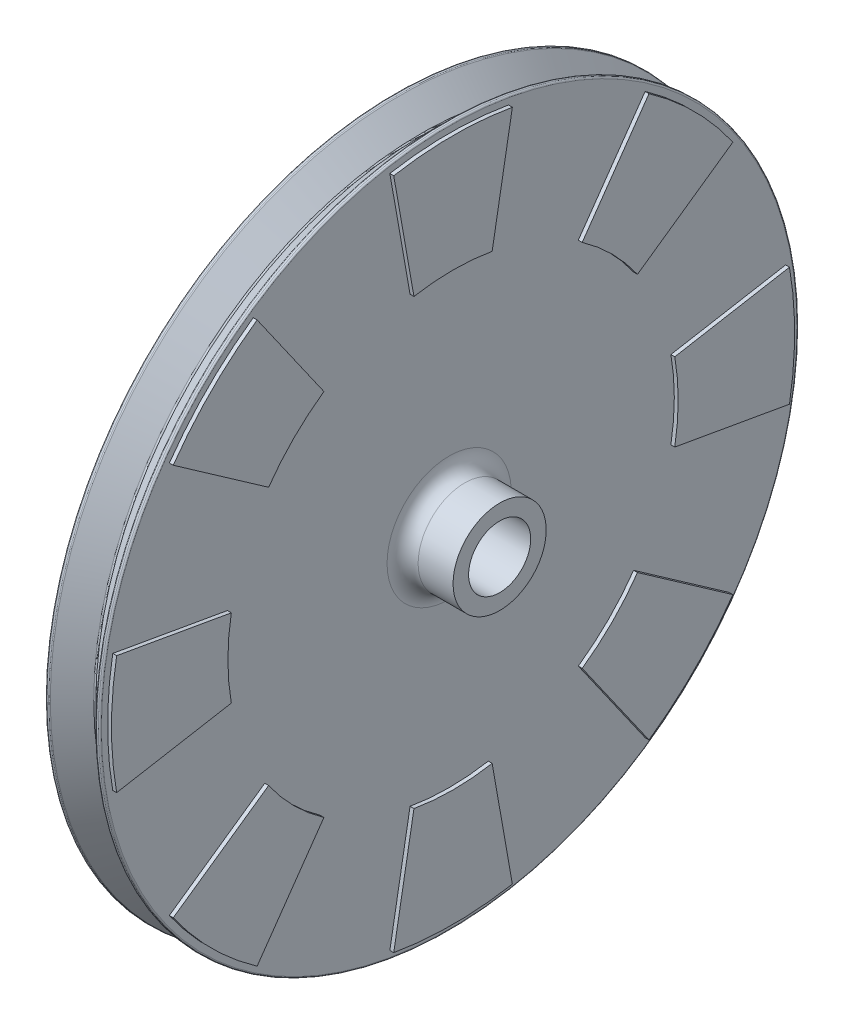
ISO-10303-21;
HEADER;
FILE_DESCRIPTION(('STEP AP214'),'2;1');
FILE_NAME('part.step','',(''),(''),'','','');
FILE_SCHEMA(('AUTOMOTIVE_DESIGN { 1 0 10303 214 1 1 1 1 }'));
ENDSEC;
DATA;
#1=APPLICATION_CONTEXT('core data for automotive mechanical design processes');
#2=APPLICATION_PROTOCOL_DEFINITION('international standard','automotive_design',2000,#1);
#3=PRODUCT_CONTEXT('',#1,'mechanical');
#4=PRODUCT('Part','Part','',(#3));
#5=PRODUCT_RELATED_PRODUCT_CATEGORY('part','',(#4));
#6=PRODUCT_DEFINITION_FORMATION('','',#4);
#7=PRODUCT_DEFINITION_CONTEXT('part definition',#1,'design');
#8=PRODUCT_DEFINITION('design','',#6,#7);
#9=PRODUCT_DEFINITION_SHAPE('','',#8);
#10=(LENGTH_UNIT() NAMED_UNIT(*) SI_UNIT(.MILLI.,.METRE.));
#11=(NAMED_UNIT(*) PLANE_ANGLE_UNIT() SI_UNIT($,.RADIAN.));
#12=(NAMED_UNIT(*) SI_UNIT($,.STERADIAN.) SOLID_ANGLE_UNIT());
#13=UNCERTAINTY_MEASURE_WITH_UNIT(LENGTH_MEASURE(1.E-05),#10,'distance_accuracy_value','');
#14=(GEOMETRIC_REPRESENTATION_CONTEXT(3) GLOBAL_UNCERTAINTY_ASSIGNED_CONTEXT((#13)) GLOBAL_UNIT_ASSIGNED_CONTEXT((#10,
#11,#12)) REPRESENTATION_CONTEXT('',''));
#15=CARTESIAN_POINT('',(0.,0.,0.));
#16=DIRECTION('',(0.,0.,1.));
#17=DIRECTION('',(1.,0.,0.));
#18=AXIS2_PLACEMENT_3D('',#15,#16,#17);
#19=CARTESIAN_POINT('',(3.5,8.00000000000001,0.));
#20=DIRECTION('',(-1.,0.,0.));
#21=DIRECTION('',(0.,0.,1.));
#22=AXIS2_PLACEMENT_3D('',#19,#20,#21);
#23=PLANE('',#22);
#24=CARTESIAN_POINT('',(3.5,0.,0.));
#25=DIRECTION('',(-1.,0.,0.));
#26=DIRECTION('',(0.,0.,1.));
#27=AXIS2_PLACEMENT_3D('',#24,#25,#26);
#28=CIRCLE('',#27,44.8);
#29=CARTESIAN_POINT('',(3.5,0.,44.8));
#30=VERTEX_POINT('',#29);
#31=EDGE_CURVE('E11',#30,#30,#28,.F.);
#32=ORIENTED_EDGE('',*,*,#31,.T.);
#33=EDGE_LOOP('',(#32));
#34=FACE_BOUND('',#33,.T.);
#35=CARTESIAN_POINT('',(3.5,0.,0.));
#36=DIRECTION('',(1.,0.,0.));
#37=DIRECTION('',(0.,-1.,0.));
#38=AXIS2_PLACEMENT_3D('',#35,#36,#37);
#39=CIRCLE('',#38,44.);
#40=CARTESIAN_POINT('',(3.5,-7.64051981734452,-43.3315411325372));
#41=VERTEX_POINT('',#40);
#42=CARTESIAN_POINT('',(3.5,7.64051981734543,-43.3315411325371));
#43=VERTEX_POINT('',#42);
#44=EDGE_CURVE('E261',#41,#43,#39,.T.);
#45=ORIENTED_EDGE('',*,*,#44,.F.);
#46=DIRECTION('',(0.,-0.173648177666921,-0.98480775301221));
#47=VECTOR('',#46,1.);
#48=CARTESIAN_POINT('',(3.5,-5.0357971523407,-28.5594248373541));
#49=LINE('',#48,#47);
#50=CARTESIAN_POINT('',(3.5,-5.03579715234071,-28.5594248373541));
#51=VERTEX_POINT('',#50);
#52=EDGE_CURVE('E274',#51,#41,#49,.T.);
#53=ORIENTED_EDGE('',*,*,#52,.F.);
#54=CARTESIAN_POINT('',(3.5,0.,0.));
#55=DIRECTION('',(-1.,0.,0.));
#56=DIRECTION('',(0.,-1.,0.));
#57=AXIS2_PLACEMENT_3D('',#54,#55,#56);
#58=CIRCLE('',#57,29.);
#59=CARTESIAN_POINT('',(3.5,5.0357971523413,-28.559424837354));
#60=VERTEX_POINT('',#59);
#61=EDGE_CURVE('E283',#60,#51,#58,.T.);
#62=ORIENTED_EDGE('',*,*,#61,.F.);
#63=DIRECTION('',(0.,-0.173648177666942,0.984807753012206));
#64=VECTOR('',#63,1.);
#65=CARTESIAN_POINT('',(3.5,5.0357971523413,-28.559424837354));
#66=LINE('',#65,#64);
#67=EDGE_CURVE('E264',#43,#60,#66,.T.);
#68=ORIENTED_EDGE('',*,*,#67,.F.);
#69=EDGE_LOOP('',(#45,#53,#62,#68));
#70=FACE_BOUND('',#69,.T.);
#71=CARTESIAN_POINT('',(3.5,0.,0.));
#72=DIRECTION('',(1.,0.,0.));
#73=DIRECTION('',(0.,0.,1.));
#74=AXIS2_PLACEMENT_3D('',#71,#72,#73);
#75=CIRCLE('',#74,44.);
#76=CARTESIAN_POINT('',(3.5,-43.3315411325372,7.64051981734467));
#77=VERTEX_POINT('',#76);
#78=CARTESIAN_POINT('',(3.5,-43.3315411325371,-7.64051981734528));
#79=VERTEX_POINT('',#78);
#80=EDGE_CURVE('E332',#77,#79,#75,.T.);
#81=ORIENTED_EDGE('',*,*,#80,.F.);
#82=DIRECTION('',(0.,-0.984807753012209,0.173648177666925));
#83=VECTOR('',#82,1.);
#84=CARTESIAN_POINT('',(3.5,-28.5594248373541,5.0357971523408));
#85=LINE('',#84,#83);
#86=CARTESIAN_POINT('',(3.5,-28.5594248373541,5.0357971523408));
#87=VERTEX_POINT('',#86);
#88=EDGE_CURVE('E337',#87,#77,#85,.T.);
#89=ORIENTED_EDGE('',*,*,#88,.F.);
#90=CARTESIAN_POINT('',(3.5,0.,0.));
#91=DIRECTION('',(-1.,0.,0.));
#92=DIRECTION('',(0.,0.,1.));
#93=AXIS2_PLACEMENT_3D('',#90,#91,#92);
#94=CIRCLE('',#93,29.);
#95=CARTESIAN_POINT('',(3.5,-28.559424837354,-5.0357971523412));
#96=VERTEX_POINT('',#95);
#97=EDGE_CURVE('E349',#96,#87,#94,.T.);
#98=ORIENTED_EDGE('',*,*,#97,.F.);
#99=DIRECTION('',(0.,0.984807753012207,0.173648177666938));
#100=VECTOR('',#99,1.);
#101=CARTESIAN_POINT('',(3.5,-28.559424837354,-5.0357971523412));
#102=LINE('',#101,#100);
#103=EDGE_CURVE('E346',#79,#96,#102,.T.);
#104=ORIENTED_EDGE('',*,*,#103,.F.);
#105=EDGE_LOOP('',(#81,#89,#98,#104));
#106=FACE_BOUND('',#105,.T.);
#107=CARTESIAN_POINT('',(3.5,0.,0.));
#108=DIRECTION('',(1.,0.,0.));
#109=DIRECTION('',(0.,1.,0.));
#110=AXIS2_PLACEMENT_3D('',#107,#108,#109);
#111=CIRCLE('',#110,44.);
#112=CARTESIAN_POINT('',(3.5,7.64051981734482,43.3315411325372));
#113=VERTEX_POINT('',#112);
#114=CARTESIAN_POINT('',(3.5,-7.64051981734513,43.3315411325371));
#115=VERTEX_POINT('',#114);
#116=EDGE_CURVE('E398',#113,#115,#111,.T.);
#117=ORIENTED_EDGE('',*,*,#116,.F.);
#118=DIRECTION('',(0.,0.173648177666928,0.984807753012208));
#119=VECTOR('',#118,1.);
#120=CARTESIAN_POINT('',(3.5,5.0357971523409,28.559424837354));
#121=LINE('',#120,#119);
#122=CARTESIAN_POINT('',(3.5,5.0357971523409,28.559424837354));
#123=VERTEX_POINT('',#122);
#124=EDGE_CURVE('E403',#123,#113,#121,.T.);
#125=ORIENTED_EDGE('',*,*,#124,.F.);
#126=CARTESIAN_POINT('',(3.5,0.,0.));
#127=DIRECTION('',(-1.,0.,0.));
#128=DIRECTION('',(0.,1.,0.));
#129=AXIS2_PLACEMENT_3D('',#126,#127,#128);
#130=CIRCLE('',#129,29.);
#131=CARTESIAN_POINT('',(3.5,-5.0357971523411,28.559424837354));
#132=VERTEX_POINT('',#131);
#133=EDGE_CURVE('E415',#132,#123,#130,.T.);
#134=ORIENTED_EDGE('',*,*,#133,.F.);
#135=DIRECTION('',(0.,0.173648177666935,-0.984807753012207));
#136=VECTOR('',#135,1.);
#137=CARTESIAN_POINT('',(3.5,-5.0357971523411,28.559424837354));
#138=LINE('',#137,#136);
#139=EDGE_CURVE('E412',#115,#132,#138,.T.);
#140=ORIENTED_EDGE('',*,*,#139,.F.);
#141=EDGE_LOOP('',(#117,#125,#134,#140));
#142=FACE_BOUND('',#141,.T.);
#143=CARTESIAN_POINT('',(3.5,0.,0.));
#144=DIRECTION('',(1.,0.,0.));
#145=DIRECTION('',(0.,0.,-1.));
#146=AXIS2_PLACEMENT_3D('',#143,#144,#145);
#147=CIRCLE('',#146,44.);
#148=CARTESIAN_POINT('',(3.5,43.3315411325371,-7.64051981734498));
#149=VERTEX_POINT('',#148);
#150=CARTESIAN_POINT('',(3.5,43.3315411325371,7.64051981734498));
#151=VERTEX_POINT('',#150);
#152=EDGE_CURVE('E464',#149,#151,#147,.T.);
#153=ORIENTED_EDGE('',*,*,#152,.F.);
#154=DIRECTION('',(0.,0.984807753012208,-0.173648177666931));
#155=VECTOR('',#154,1.);
#156=CARTESIAN_POINT('',(3.5,28.559424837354,-5.035797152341));
#157=LINE('',#156,#155);
#158=CARTESIAN_POINT('',(3.5,28.559424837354,-5.035797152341));
#159=VERTEX_POINT('',#158);
#160=EDGE_CURVE('E469',#159,#149,#157,.T.);
#161=ORIENTED_EDGE('',*,*,#160,.F.);
#162=CARTESIAN_POINT('',(3.5,0.,0.));
#163=DIRECTION('',(-1.,0.,0.));
#164=DIRECTION('',(0.,0.,-1.));
#165=AXIS2_PLACEMENT_3D('',#162,#163,#164);
#166=CIRCLE('',#165,29.);
#167=CARTESIAN_POINT('',(3.5,28.559424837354,5.035797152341));
#168=VERTEX_POINT('',#167);
#169=EDGE_CURVE('E481',#168,#159,#166,.T.);
#170=ORIENTED_EDGE('',*,*,#169,.F.);
#171=DIRECTION('',(0.,-0.984807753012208,-0.173648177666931));
#172=VECTOR('',#171,1.);
#173=CARTESIAN_POINT('',(3.5,28.559424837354,5.035797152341));
#174=LINE('',#173,#172);
#175=EDGE_CURVE('E478',#151,#168,#174,.T.);
#176=ORIENTED_EDGE('',*,*,#175,.F.);
#177=EDGE_LOOP('',(#153,#161,#170,#176));
#178=FACE_BOUND('',#177,.T.);
#179=CARTESIAN_POINT('',(3.5,0.,0.));
#180=DIRECTION('',(-1.,0.,0.));
#181=DIRECTION('',(0.,0.,1.));
#182=AXIS2_PLACEMENT_3D('',#179,#180,#181);
#183=CIRCLE('',#182,8.00000000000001);
#184=CARTESIAN_POINT('',(3.5,0.,8.00000000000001));
#185=VERTEX_POINT('',#184);
#186=EDGE_CURVE('E497',#185,#185,#183,.T.);
#187=ORIENTED_EDGE('',*,*,#186,.T.);
#188=EDGE_LOOP('',(#187));
#189=FACE_BOUND('',#188,.T.);
#190=CARTESIAN_POINT('',(3.5,0.,0.));
#191=DIRECTION('',(1.,0.,0.));
#192=DIRECTION('',(0.,0.707106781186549,-0.707106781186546));
#193=AXIS2_PLACEMENT_3D('',#190,#191,#192);
#194=CIRCLE('',#193,44.);
#195=CARTESIAN_POINT('',(3.5,36.0426899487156,25.2373631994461));
#196=VERTEX_POINT('',#195);
#197=CARTESIAN_POINT('',(3.5,25.2373631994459,36.0426899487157));
#198=VERTEX_POINT('',#197);
#199=EDGE_CURVE('E431',#196,#198,#194,.T.);
#200=ORIENTED_EDGE('',*,*,#199,.F.);
#201=DIRECTION('',(0.,0.819152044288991,0.573576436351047));
#202=VECTOR('',#201,1.);
#203=CARTESIAN_POINT('',(3.5,23.7554092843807,16.6337166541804));
#204=LINE('',#203,#202);
#205=CARTESIAN_POINT('',(3.5,23.7554092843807,16.6337166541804));
#206=VERTEX_POINT('',#205);
#207=EDGE_CURVE('E436',#206,#196,#204,.T.);
#208=ORIENTED_EDGE('',*,*,#207,.F.);
#209=CARTESIAN_POINT('',(3.5,0.,0.));
#210=DIRECTION('',(-1.,0.,0.));
#211=DIRECTION('',(0.,0.707106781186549,-0.707106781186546));
#212=AXIS2_PLACEMENT_3D('',#209,#210,#211);
#213=CIRCLE('',#212,29.);
#214=CARTESIAN_POINT('',(3.5,16.6337166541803,23.7554092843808));
#215=VERTEX_POINT('',#214);
#216=EDGE_CURVE('E448',#215,#206,#213,.T.);
#217=ORIENTED_EDGE('',*,*,#216,.F.);
#218=DIRECTION('',(0.,-0.573576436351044,-0.819152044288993));
#219=VECTOR('',#218,1.);
#220=CARTESIAN_POINT('',(3.5,16.6337166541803,23.7554092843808));
#221=LINE('',#220,#219);
#222=EDGE_CURVE('E445',#198,#215,#221,.T.);
#223=ORIENTED_EDGE('',*,*,#222,.F.);
#224=EDGE_LOOP('',(#200,#208,#217,#223));
#225=FACE_BOUND('',#224,.T.);
#226=CARTESIAN_POINT('',(3.5,0.,0.));
#227=DIRECTION('',(1.,0.,0.));
#228=DIRECTION('',(0.,0.707106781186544,0.707106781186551));
#229=AXIS2_PLACEMENT_3D('',#226,#227,#228);
#230=CIRCLE('',#229,44.);
#231=CARTESIAN_POINT('',(3.5,-25.2373631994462,36.0426899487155));
#232=VERTEX_POINT('',#231);
#233=CARTESIAN_POINT('',(3.5,-36.0426899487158,25.2373631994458));
#234=VERTEX_POINT('',#233);
#235=EDGE_CURVE('E365',#232,#234,#230,.T.);
#236=ORIENTED_EDGE('',*,*,#235,.F.);
#237=DIRECTION('',(0.,-0.573576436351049,0.819152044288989));
#238=VECTOR('',#237,1.);
#239=CARTESIAN_POINT('',(3.5,-16.6337166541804,23.7554092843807));
#240=LINE('',#239,#238);
#241=CARTESIAN_POINT('',(3.5,-16.6337166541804,23.7554092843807));
#242=VERTEX_POINT('',#241);
#243=EDGE_CURVE('E370',#242,#232,#240,.T.);
#244=ORIENTED_EDGE('',*,*,#243,.F.);
#245=CARTESIAN_POINT('',(3.5,0.,0.));
#246=DIRECTION('',(-1.,0.,0.));
#247=DIRECTION('',(0.,0.707106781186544,0.707106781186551));
#248=AXIS2_PLACEMENT_3D('',#245,#246,#247);
#249=CIRCLE('',#248,29.);
#250=CARTESIAN_POINT('',(3.5,-23.7554092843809,16.6337166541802));
#251=VERTEX_POINT('',#250);
#252=EDGE_CURVE('E382',#251,#242,#249,.T.);
#253=ORIENTED_EDGE('',*,*,#252,.F.);
#254=DIRECTION('',(0.,0.819152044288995,-0.573576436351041));
#255=VECTOR('',#254,1.);
#256=CARTESIAN_POINT('',(3.5,-23.7554092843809,16.6337166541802));
#257=LINE('',#256,#255);
#258=EDGE_CURVE('E379',#234,#251,#257,.T.);
#259=ORIENTED_EDGE('',*,*,#258,.F.);
#260=EDGE_LOOP('',(#236,#244,#253,#259));
#261=FACE_BOUND('',#260,.T.);
#262=CARTESIAN_POINT('',(3.5,0.,0.));
#263=DIRECTION('',(1.,0.,0.));
#264=DIRECTION('',(0.,-0.707106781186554,0.707106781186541));
#265=AXIS2_PLACEMENT_3D('',#262,#263,#264);
#266=CIRCLE('',#265,44.);
#267=CARTESIAN_POINT('',(3.5,-36.0426899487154,-25.2373631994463));
#268=VERTEX_POINT('',#267);
#269=CARTESIAN_POINT('',(3.5,-25.2373631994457,-36.0426899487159));
#270=VERTEX_POINT('',#269);
#271=EDGE_CURVE('E299',#268,#270,#266,.T.);
#272=ORIENTED_EDGE('',*,*,#271,.F.);
#273=DIRECTION('',(0.,-0.819152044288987,-0.573576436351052));
#274=VECTOR('',#273,1.);
#275=CARTESIAN_POINT('',(3.5,-23.7554092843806,-16.6337166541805));
#276=LINE('',#275,#274);
#277=CARTESIAN_POINT('',(3.5,-23.7554092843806,-16.6337166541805));
#278=VERTEX_POINT('',#277);
#279=EDGE_CURVE('E304',#278,#268,#276,.T.);
#280=ORIENTED_EDGE('',*,*,#279,.F.);
#281=CARTESIAN_POINT('',(3.5,0.,0.));
#282=DIRECTION('',(-1.,0.,0.));
#283=DIRECTION('',(0.,-0.707106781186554,0.707106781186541));
#284=AXIS2_PLACEMENT_3D('',#281,#282,#283);
#285=CIRCLE('',#284,29.);
#286=CARTESIAN_POINT('',(3.5,-16.6337166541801,-23.7554092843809));
#287=VERTEX_POINT('',#286);
#288=EDGE_CURVE('E316',#287,#278,#285,.T.);
#289=ORIENTED_EDGE('',*,*,#288,.F.);
#290=DIRECTION('',(0.,0.573576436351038,0.819152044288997));
#291=VECTOR('',#290,1.);
#292=CARTESIAN_POINT('',(3.5,-16.6337166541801,-23.7554092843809));
#293=LINE('',#292,#291);
#294=EDGE_CURVE('E313',#270,#287,#293,.T.);
#295=ORIENTED_EDGE('',*,*,#294,.F.);
#296=EDGE_LOOP('',(#272,#280,#289,#295));
#297=FACE_BOUND('',#296,.T.);
#298=CARTESIAN_POINT('',(3.5,0.,0.));
#299=DIRECTION('',(1.,0.,0.));
#300=DIRECTION('',(0.,-0.707106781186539,-0.707106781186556));
#301=AXIS2_PLACEMENT_3D('',#298,#299,#300);
#302=CIRCLE('',#301,44.);
#303=CARTESIAN_POINT('',(3.5,25.2373631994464,-36.0426899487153));
#304=VERTEX_POINT('',#303);
#305=CARTESIAN_POINT('',(3.5,36.042689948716,-25.2373631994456));
#306=VERTEX_POINT('',#305);
#307=EDGE_CURVE('E260',#304,#306,#302,.T.);
#308=ORIENTED_EDGE('',*,*,#307,.F.);
#309=DIRECTION('',(0.,0.573576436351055,-0.819152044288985));
#310=VECTOR('',#309,1.);
#311=CARTESIAN_POINT('',(3.5,16.6337166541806,-23.7554092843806));
#312=LINE('',#311,#310);
#313=CARTESIAN_POINT('',(3.5,16.6337166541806,-23.7554092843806));
#314=VERTEX_POINT('',#313);
#315=EDGE_CURVE('E257',#314,#304,#312,.T.);
#316=ORIENTED_EDGE('',*,*,#315,.F.);
#317=CARTESIAN_POINT('',(3.5,0.,0.));
#318=DIRECTION('',(-1.,0.,0.));
#319=DIRECTION('',(0.,-0.707106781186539,-0.707106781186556));
#320=AXIS2_PLACEMENT_3D('',#317,#318,#319);
#321=CIRCLE('',#320,29.);
#322=CARTESIAN_POINT('',(3.5,23.755409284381,-16.63371665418));
#323=VERTEX_POINT('',#322);
#324=EDGE_CURVE('E51',#323,#314,#321,.T.);
#325=ORIENTED_EDGE('',*,*,#324,.F.);
#326=DIRECTION('',(0.,-0.819152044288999,0.573576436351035));
#327=VECTOR('',#326,1.);
#328=CARTESIAN_POINT('',(3.5,23.755409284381,-16.63371665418));
#329=LINE('',#328,#327);
#330=EDGE_CURVE('E46',#306,#323,#329,.T.);
#331=ORIENTED_EDGE('',*,*,#330,.F.);
#332=EDGE_LOOP('',(#308,#316,#325,#331));
#333=FACE_BOUND('',#332,.T.);
#334=ADVANCED_FACE('F31',(#34,#70,#106,#142,#178,#189,#225,#261,#297,#333),#23,.F.);
#335=CARTESIAN_POINT('',(0.,4.,0.));
#336=DIRECTION('',(-1.,0.,0.));
#337=DIRECTION('',(0.,0.,1.));
#338=AXIS2_PLACEMENT_3D('',#335,#336,#337);
#339=PLANE('',#338);
#340=CARTESIAN_POINT('',(0.,0.,0.));
#341=DIRECTION('',(-1.,0.,0.));
#342=DIRECTION('',(0.,0.,1.));
#343=AXIS2_PLACEMENT_3D('',#340,#341,#342);
#344=CIRCLE('',#343,4.);
#345=CARTESIAN_POINT('',(0.,0.,4.));
#346=VERTEX_POINT('',#345);
#347=EDGE_CURVE('E509',#346,#346,#344,.T.);
#348=ORIENTED_EDGE('',*,*,#347,.F.);
#349=EDGE_LOOP('',(#348));
#350=FACE_BOUND('',#349,.T.);
#351=ADVANCED_FACE('F556',(#350),#339,.F.);
#352=CARTESIAN_POINT('',(0.,0.,0.));
#353=DIRECTION('',(-1.,0.,0.));
#354=DIRECTION('',(0.,0.,1.));
#355=AXIS2_PLACEMENT_3D('',#352,#353,#354);
#356=CYLINDRICAL_SURFACE('',#355,4.);
#357=CARTESIAN_POINT('',(10.,0.,0.));
#358=DIRECTION('',(-1.,0.,0.));
#359=DIRECTION('',(0.,0.,1.));
#360=AXIS2_PLACEMENT_3D('',#357,#358,#359);
#361=CIRCLE('',#360,4.);
#362=CARTESIAN_POINT('',(10.,0.,4.));
#363=VERTEX_POINT('',#362);
#364=EDGE_CURVE('E506',#363,#363,#361,.T.);
#365=ORIENTED_EDGE('',*,*,#364,.F.);
#366=EDGE_LOOP('',(#365));
#367=FACE_BOUND('',#366,.T.);
#368=ORIENTED_EDGE('',*,*,#347,.T.);
#369=EDGE_LOOP('',(#368));
#370=FACE_BOUND('',#369,.T.);
#371=ADVANCED_FACE('F562',(#367,#370),#356,.F.);
#372=CARTESIAN_POINT('',(10.,6.,0.));
#373=DIRECTION('',(-1.,0.,0.));
#374=DIRECTION('',(0.,0.,1.));
#375=AXIS2_PLACEMENT_3D('',#372,#373,#374);
#376=PLANE('',#375);
#377=CARTESIAN_POINT('',(10.,0.,0.));
#378=DIRECTION('',(-1.,0.,0.));
#379=DIRECTION('',(0.,0.,1.));
#380=AXIS2_PLACEMENT_3D('',#377,#378,#379);
#381=CIRCLE('',#380,6.);
#382=CARTESIAN_POINT('',(10.,0.,6.));
#383=VERTEX_POINT('',#382);
#384=EDGE_CURVE('E503',#383,#383,#381,.T.);
#385=ORIENTED_EDGE('',*,*,#384,.F.);
#386=EDGE_LOOP('',(#385));
#387=FACE_BOUND('',#386,.T.);
#388=ORIENTED_EDGE('',*,*,#364,.T.);
#389=EDGE_LOOP('',(#388));
#390=FACE_BOUND('',#389,.T.);
#391=ADVANCED_FACE('F576',(#387,#390),#376,.F.);
#392=CARTESIAN_POINT('',(0.,0.,0.));
#393=DIRECTION('',(-1.,0.,0.));
#394=DIRECTION('',(0.,0.,1.));
#395=AXIS2_PLACEMENT_3D('',#392,#393,#394);
#396=CYLINDRICAL_SURFACE('',#395,6.);
#397=CARTESIAN_POINT('',(5.50000000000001,0.,0.));
#398=DIRECTION('',(-1.,0.,0.));
#399=DIRECTION('',(0.,0.,1.));
#400=AXIS2_PLACEMENT_3D('',#397,#398,#399);
#401=CIRCLE('',#400,6.);
#402=CARTESIAN_POINT('',(5.50000000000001,0.,6.));
#403=VERTEX_POINT('',#402);
#404=EDGE_CURVE('E500',#403,#403,#401,.T.);
#405=ORIENTED_EDGE('',*,*,#404,.F.);
#406=EDGE_LOOP('',(#405));
#407=FACE_BOUND('',#406,.T.);
#408=ORIENTED_EDGE('',*,*,#384,.T.);
#409=EDGE_LOOP('',(#408));
#410=FACE_BOUND('',#409,.T.);
#411=ADVANCED_FACE('F572',(#407,#410),#396,.T.);
#412=CARTESIAN_POINT('',(5.5,0.,0.));
#413=DIRECTION('',(-1.,0.,0.));
#414=DIRECTION('',(0.,0.,1.));
#415=AXIS2_PLACEMENT_3D('',#412,#413,#414);
#416=TOROIDAL_SURFACE('',#415,8.,2.);
#417=ORIENTED_EDGE('',*,*,#186,.F.);
#418=EDGE_LOOP('',(#417));
#419=FACE_BOUND('',#418,.T.);
#420=ORIENTED_EDGE('',*,*,#404,.T.);
#421=EDGE_LOOP('',(#420));
#422=FACE_BOUND('',#421,.T.);
#423=ADVANCED_FACE('F569',(#419,#422),#416,.F.);
#424=CARTESIAN_POINT('',(0.,0.,0.));
#425=DIRECTION('',(-1.,0.,0.));
#426=DIRECTION('',(0.,0.,1.));
#427=AXIS2_PLACEMENT_3D('',#424,#425,#426);
#428=CYLINDRICAL_SURFACE('',#427,45.);
#429=CARTESIAN_POINT('',(3.3,0.,0.));
#430=DIRECTION('',(-1.,0.,0.));
#431=DIRECTION('',(0.,0.,1.));
#432=AXIS2_PLACEMENT_3D('',#429,#430,#431);
#433=CIRCLE('',#432,45.);
#434=CARTESIAN_POINT('',(3.3,0.,45.));
#435=VERTEX_POINT('',#434);
#436=EDGE_CURVE('E39',#435,#435,#433,.T.);
#437=ORIENTED_EDGE('',*,*,#436,.T.);
#438=EDGE_LOOP('',(#437));
#439=FACE_BOUND('',#438,.T.);
#440=CARTESIAN_POINT('',(3.08284271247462,0.,0.));
#441=DIRECTION('',(1.,0.,0.));
#442=DIRECTION('',(0.,0.,-1.));
#443=AXIS2_PLACEMENT_3D('',#440,#441,#442);
#444=CIRCLE('',#443,45.);
#445=CARTESIAN_POINT('',(3.08284271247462,0.,-45.));
#446=VERTEX_POINT('',#445);
#447=EDGE_CURVE('E533',#446,#446,#444,.T.);
#448=ORIENTED_EDGE('',*,*,#447,.T.);
#449=EDGE_LOOP('',(#448));
#450=FACE_BOUND('',#449,.T.);
#451=ADVANCED_FACE('F538',(#439,#450),#428,.T.);
#452=CARTESIAN_POINT('',(3.,0.,0.));
#453=DIRECTION('',(1.,0.,0.));
#454=DIRECTION('',(0.,0.,-1.));
#455=AXIS2_PLACEMENT_3D('',#452,#453,#454);
#456=CONICAL_SURFACE('',#455,45.,0.785398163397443);
#457=CARTESIAN_POINT('',(0.141421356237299,0.,0.));
#458=DIRECTION('',(1.,0.,0.));
#459=DIRECTION('',(0.,0.,-1.));
#460=AXIS2_PLACEMENT_3D('',#457,#458,#459);
#461=CIRCLE('',#460,42.1414213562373);
#462=CARTESIAN_POINT('',(0.141421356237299,0.,-42.1414213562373));
#463=VERTEX_POINT('',#462);
#464=EDGE_CURVE('E521',#463,#463,#461,.T.);
#465=ORIENTED_EDGE('',*,*,#464,.T.);
#466=EDGE_LOOP('',(#465));
#467=FACE_BOUND('',#466,.T.);
#468=CARTESIAN_POINT('',(2.94142135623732,0.,0.));
#469=DIRECTION('',(-1.,0.,0.));
#470=DIRECTION('',(0.,0.,1.));
#471=AXIS2_PLACEMENT_3D('',#468,#469,#470);
#472=CIRCLE('',#471,44.9414213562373);
#473=CARTESIAN_POINT('',(2.94142135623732,0.,44.9414213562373));
#474=VERTEX_POINT('',#473);
#475=EDGE_CURVE('E518',#474,#474,#472,.T.);
#476=ORIENTED_EDGE('',*,*,#475,.T.);
#477=EDGE_LOOP('',(#476));
#478=FACE_BOUND('',#477,.T.);
#479=ADVANCED_FACE('F620',(#467,#478),#456,.T.);
#480=CARTESIAN_POINT('',(0.,0.,0.));
#481=DIRECTION('',(-1.,0.,0.));
#482=DIRECTION('',(0.,0.,1.));
#483=AXIS2_PLACEMENT_3D('',#480,#481,#482);
#484=CONICAL_SURFACE('',#483,42.,0.785398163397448);
#485=CARTESIAN_POINT('',(-0.141421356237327,0.,0.));
#486=DIRECTION('',(-1.,0.,0.));
#487=DIRECTION('',(0.,0.,1.));
#488=AXIS2_PLACEMENT_3D('',#485,#486,#487);
#489=CIRCLE('',#488,42.1414213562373);
#490=CARTESIAN_POINT('',(-0.141421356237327,0.,42.1414213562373));
#491=VERTEX_POINT('',#490);
#492=EDGE_CURVE('E515',#491,#491,#489,.T.);
#493=ORIENTED_EDGE('',*,*,#492,.T.);
#494=EDGE_LOOP('',(#493));
#495=FACE_BOUND('',#494,.T.);
#496=CARTESIAN_POINT('',(-2.9414213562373,0.,0.));
#497=DIRECTION('',(1.,0.,0.));
#498=DIRECTION('',(0.,0.,-1.));
#499=AXIS2_PLACEMENT_3D('',#496,#497,#498);
#500=CIRCLE('',#499,44.9414213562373);
#501=CARTESIAN_POINT('',(-2.9414213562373,0.,-44.9414213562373));
#502=VERTEX_POINT('',#501);
#503=EDGE_CURVE('E512',#502,#502,#500,.T.);
#504=ORIENTED_EDGE('',*,*,#503,.T.);
#505=EDGE_LOOP('',(#504));
#506=FACE_BOUND('',#505,.T.);
#507=ADVANCED_FACE('F600',(#495,#506),#484,.T.);
#508=CARTESIAN_POINT('',(0.,0.,0.));
#509=DIRECTION('',(-1.,0.,0.));
#510=DIRECTION('',(0.,0.,1.));
#511=AXIS2_PLACEMENT_3D('',#508,#509,#510);
#512=CYLINDRICAL_SURFACE('',#511,45.);
#513=CARTESIAN_POINT('',(-3.08284271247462,0.,0.));
#514=DIRECTION('',(1.,0.,0.));
#515=DIRECTION('',(0.,0.,-1.));
#516=AXIS2_PLACEMENT_3D('',#513,#514,#515);
#517=CIRCLE('',#516,45.);
#518=CARTESIAN_POINT('',(-3.08284271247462,0.,-45.));
#519=VERTEX_POINT('',#518);
#520=EDGE_CURVE('E527',#519,#519,#517,.F.);
#521=ORIENTED_EDGE('',*,*,#520,.T.);
#522=EDGE_LOOP('',(#521));
#523=FACE_BOUND('',#522,.T.);
#524=CARTESIAN_POINT('',(-3.3,0.,0.));
#525=DIRECTION('',(1.,0.,0.));
#526=DIRECTION('',(0.,0.,-1.));
#527=AXIS2_PLACEMENT_3D('',#524,#525,#526);
#528=CIRCLE('',#527,45.);
#529=CARTESIAN_POINT('',(-3.3,0.,-45.));
#530=VERTEX_POINT('',#529);
#531=EDGE_CURVE('E524',#530,#530,#528,.T.);
#532=ORIENTED_EDGE('',*,*,#531,.T.);
#533=EDGE_LOOP('',(#532));
#534=FACE_BOUND('',#533,.T.);
#535=ADVANCED_FACE('F596',(#523,#534),#512,.T.);
#536=CARTESIAN_POINT('',(-3.5,0.,0.));
#537=DIRECTION('',(1.,0.,0.));
#538=DIRECTION('',(0.,0.,-1.));
#539=AXIS2_PLACEMENT_3D('',#536,#537,#538);
#540=PLANE('',#539);
#541=CARTESIAN_POINT('',(-3.5,10.7616479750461,-32.0176613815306));
#542=DIRECTION('',(-1.,0.,0.));
#543=DIRECTION('',(0.,0.,1.));
#544=AXIS2_PLACEMENT_3D('',#541,#542,#543);
#545=CIRCLE('',#544,2.02379734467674);
#546=CARTESIAN_POINT('',(-3.5,10.7616479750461,-29.9938640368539));
#547=VERTEX_POINT('',#546);
#548=EDGE_CURVE('E1086',#547,#547,#545,.T.);
#549=ORIENTED_EDGE('',*,*,#548,.F.);
#550=EDGE_LOOP('',(#549));
#551=FACE_BOUND('',#550,.T.);
#552=CARTESIAN_POINT('',(-3.5,0.,0.));
#553=DIRECTION('',(1.,0.,0.));
#554=DIRECTION('',(0.,0.,-1.));
#555=AXIS2_PLACEMENT_3D('',#552,#553,#554);
#556=CIRCLE('',#555,44.8);
#557=CARTESIAN_POINT('',(-3.5,0.,-44.8));
#558=VERTEX_POINT('',#557);
#559=EDGE_CURVE('E530',#558,#558,#556,.F.);
#560=ORIENTED_EDGE('',*,*,#559,.T.);
#561=EDGE_LOOP('',(#560));
#562=FACE_BOUND('',#561,.T.);
#563=ADVANCED_FACE('F599',(#551,#562),#540,.F.);
#564=CARTESIAN_POINT('',(4.,0.,0.));
#565=DIRECTION('',(-1.,0.,0.));
#566=DIRECTION('',(0.,0.,1.));
#567=AXIS2_PLACEMENT_3D('',#564,#565,#566);
#568=CYLINDRICAL_SURFACE('',#567,44.);
#569=ORIENTED_EDGE('',*,*,#152,.T.);
#570=DIRECTION('',(-1.,0.,0.));
#571=VECTOR('',#570,1.);
#572=CARTESIAN_POINT('',(4.,43.3315411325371,7.64051981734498));
#573=LINE('',#572,#571);
#574=CARTESIAN_POINT('',(4.,43.3315411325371,7.64051981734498));
#575=VERTEX_POINT('',#574);
#576=EDGE_CURVE('E494',#575,#151,#573,.T.);
#577=ORIENTED_EDGE('',*,*,#576,.F.);
#578=CARTESIAN_POINT('',(4.,0.,0.));
#579=DIRECTION('',(1.,0.,0.));
#580=DIRECTION('',(0.,0.,-1.));
#581=AXIS2_PLACEMENT_3D('',#578,#579,#580);
#582=CIRCLE('',#581,44.);
#583=CARTESIAN_POINT('',(4.,43.3315411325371,-7.64051981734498));
#584=VERTEX_POINT('',#583);
#585=EDGE_CURVE('E465',#584,#575,#582,.T.);
#586=ORIENTED_EDGE('',*,*,#585,.F.);
#587=DIRECTION('',(-1.,0.,0.));
#588=VECTOR('',#587,1.);
#589=CARTESIAN_POINT('',(4.,43.3315411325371,-7.64051981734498));
#590=LINE('',#589,#588);
#591=EDGE_CURVE('E475',#584,#149,#590,.T.);
#592=ORIENTED_EDGE('',*,*,#591,.T.);
#593=EDGE_LOOP('',(#569,#577,#586,#592));
#594=FACE_BOUND('',#593,.T.);
#595=ADVANCED_FACE('F607',(#594),#568,.T.);
#596=CARTESIAN_POINT('',(4.,28.559424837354,5.035797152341));
#597=DIRECTION('',(0.,0.173648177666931,-0.984807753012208));
#598=DIRECTION('',(0.,0.984807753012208,0.173648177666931));
#599=AXIS2_PLACEMENT_3D('',#596,#597,#598);
#600=PLANE('',#599);
#601=ORIENTED_EDGE('',*,*,#175,.T.);
#602=DIRECTION('',(-1.,0.,0.));
#603=VECTOR('',#602,1.);
#604=CARTESIAN_POINT('',(4.,28.559424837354,5.035797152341));
#605=LINE('',#604,#603);
#606=CARTESIAN_POINT('',(4.,28.559424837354,5.035797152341));
#607=VERTEX_POINT('',#606);
#608=EDGE_CURVE('E491',#607,#168,#605,.T.);
#609=ORIENTED_EDGE('',*,*,#608,.F.);
#610=DIRECTION('',(0.,-0.984807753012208,-0.173648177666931));
#611=VECTOR('',#610,1.);
#612=CARTESIAN_POINT('',(4.,28.559424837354,5.035797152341));
#613=LINE('',#612,#611);
#614=EDGE_CURVE('E468',#575,#607,#613,.T.);
#615=ORIENTED_EDGE('',*,*,#614,.F.);
#616=ORIENTED_EDGE('',*,*,#576,.T.);
#617=EDGE_LOOP('',(#601,#609,#615,#616));
#618=FACE_BOUND('',#617,.T.);
#619=ADVANCED_FACE('F613',(#618),#600,.F.);
#620=CARTESIAN_POINT('',(4.,0.,0.));
#621=DIRECTION('',(-1.,0.,0.));
#622=DIRECTION('',(0.,0.,1.));
#623=AXIS2_PLACEMENT_3D('',#620,#621,#622);
#624=CYLINDRICAL_SURFACE('',#623,29.);
#625=ORIENTED_EDGE('',*,*,#169,.T.);
#626=DIRECTION('',(-1.,0.,0.));
#627=VECTOR('',#626,1.);
#628=CARTESIAN_POINT('',(4.,28.559424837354,-5.035797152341));
#629=LINE('',#628,#627);
#630=CARTESIAN_POINT('',(4.,28.559424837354,-5.035797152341));
#631=VERTEX_POINT('',#630);
#632=EDGE_CURVE('E488',#631,#159,#629,.T.);
#633=ORIENTED_EDGE('',*,*,#632,.F.);
#634=CARTESIAN_POINT('',(4.,0.,0.));
#635=DIRECTION('',(-1.,0.,0.));
#636=DIRECTION('',(0.,0.,-1.));
#637=AXIS2_PLACEMENT_3D('',#634,#635,#636);
#638=CIRCLE('',#637,29.);
#639=EDGE_CURVE('E471',#607,#631,#638,.T.);
#640=ORIENTED_EDGE('',*,*,#639,.F.);
#641=ORIENTED_EDGE('',*,*,#608,.T.);
#642=EDGE_LOOP('',(#625,#633,#640,#641));
#643=FACE_BOUND('',#642,.T.);
#644=ADVANCED_FACE('F702',(#643),#624,.F.);
#645=CARTESIAN_POINT('',(4.,28.559424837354,-5.035797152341));
#646=DIRECTION('',(0.,0.173648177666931,0.984807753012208));
#647=DIRECTION('',(0.,-0.984807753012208,0.173648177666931));
#648=AXIS2_PLACEMENT_3D('',#645,#646,#647);
#649=PLANE('',#648);
#650=ORIENTED_EDGE('',*,*,#160,.T.);
#651=ORIENTED_EDGE('',*,*,#591,.F.);
#652=DIRECTION('',(0.,0.984807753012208,-0.173648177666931));
#653=VECTOR('',#652,1.);
#654=CARTESIAN_POINT('',(4.,28.559424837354,-5.035797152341));
#655=LINE('',#654,#653);
#656=EDGE_CURVE('E473',#631,#584,#655,.T.);
#657=ORIENTED_EDGE('',*,*,#656,.F.);
#658=ORIENTED_EDGE('',*,*,#632,.T.);
#659=EDGE_LOOP('',(#650,#651,#657,#658));
#660=FACE_BOUND('',#659,.T.);
#661=ADVANCED_FACE('F710',(#660),#649,.F.);
#662=CARTESIAN_POINT('',(4.,0.,0.));
#663=DIRECTION('',(1.,0.,0.));
#664=DIRECTION('',(0.,0.,-1.));
#665=AXIS2_PLACEMENT_3D('',#662,#663,#664);
#666=PLANE('',#665);
#667=ORIENTED_EDGE('',*,*,#585,.T.);
#668=ORIENTED_EDGE('',*,*,#614,.T.);
#669=ORIENTED_EDGE('',*,*,#639,.T.);
#670=ORIENTED_EDGE('',*,*,#656,.T.);
#671=EDGE_LOOP('',(#667,#668,#669,#670));
#672=FACE_BOUND('',#671,.T.);
#673=ADVANCED_FACE('F719',(#672),#666,.T.);
#674=CARTESIAN_POINT('',(4.,0.,0.));
#675=DIRECTION('',(-1.,0.,0.));
#676=DIRECTION('',(0.,0.,1.));
#677=AXIS2_PLACEMENT_3D('',#674,#675,#676);
#678=CYLINDRICAL_SURFACE('',#677,44.);
#679=ORIENTED_EDGE('',*,*,#199,.T.);
#680=DIRECTION('',(-1.,0.,0.));
#681=VECTOR('',#680,1.);
#682=CARTESIAN_POINT('',(4.,25.2373631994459,36.0426899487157));
#683=LINE('',#682,#681);
#684=CARTESIAN_POINT('',(4.,25.2373631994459,36.0426899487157));
#685=VERTEX_POINT('',#684);
#686=EDGE_CURVE('E461',#685,#198,#683,.T.);
#687=ORIENTED_EDGE('',*,*,#686,.F.);
#688=CARTESIAN_POINT('',(4.,0.,0.));
#689=DIRECTION('',(1.,0.,0.));
#690=DIRECTION('',(0.,0.707106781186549,-0.707106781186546));
#691=AXIS2_PLACEMENT_3D('',#688,#689,#690);
#692=CIRCLE('',#691,44.);
#693=CARTESIAN_POINT('',(4.,36.0426899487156,25.2373631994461));
#694=VERTEX_POINT('',#693);
#695=EDGE_CURVE('E432',#694,#685,#692,.T.);
#696=ORIENTED_EDGE('',*,*,#695,.F.);
#697=DIRECTION('',(-1.,0.,0.));
#698=VECTOR('',#697,1.);
#699=CARTESIAN_POINT('',(4.,36.0426899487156,25.2373631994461));
#700=LINE('',#699,#698);
#701=EDGE_CURVE('E442',#694,#196,#700,.T.);
#702=ORIENTED_EDGE('',*,*,#701,.T.);
#703=EDGE_LOOP('',(#679,#687,#696,#702));
#704=FACE_BOUND('',#703,.T.);
#705=ADVANCED_FACE('F728',(#704),#678,.T.);
#706=CARTESIAN_POINT('',(4.,16.6337166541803,23.7554092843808));
#707=DIRECTION('',(0.,0.819152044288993,-0.573576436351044));
#708=DIRECTION('',(0.,0.573576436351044,0.819152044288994));
#709=AXIS2_PLACEMENT_3D('',#706,#707,#708);
#710=PLANE('',#709);
#711=ORIENTED_EDGE('',*,*,#222,.T.);
#712=DIRECTION('',(-1.,0.,0.));
#713=VECTOR('',#712,1.);
#714=CARTESIAN_POINT('',(4.,16.6337166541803,23.7554092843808));
#715=LINE('',#714,#713);
#716=CARTESIAN_POINT('',(4.,16.6337166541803,23.7554092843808));
#717=VERTEX_POINT('',#716);
#718=EDGE_CURVE('E458',#717,#215,#715,.T.);
#719=ORIENTED_EDGE('',*,*,#718,.F.);
#720=DIRECTION('',(0.,-0.573576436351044,-0.819152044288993));
#721=VECTOR('',#720,1.);
#722=CARTESIAN_POINT('',(4.,16.6337166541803,23.7554092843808));
#723=LINE('',#722,#721);
#724=EDGE_CURVE('E435',#685,#717,#723,.T.);
#725=ORIENTED_EDGE('',*,*,#724,.F.);
#726=ORIENTED_EDGE('',*,*,#686,.T.);
#727=EDGE_LOOP('',(#711,#719,#725,#726));
#728=FACE_BOUND('',#727,.T.);
#729=ADVANCED_FACE('F742',(#728),#710,.F.);
#730=CARTESIAN_POINT('',(4.,0.,0.));
#731=DIRECTION('',(-1.,0.,0.));
#732=DIRECTION('',(0.,0.,1.));
#733=AXIS2_PLACEMENT_3D('',#730,#731,#732);
#734=CYLINDRICAL_SURFACE('',#733,29.);
#735=ORIENTED_EDGE('',*,*,#216,.T.);
#736=DIRECTION('',(-1.,0.,0.));
#737=VECTOR('',#736,1.);
#738=CARTESIAN_POINT('',(4.,23.7554092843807,16.6337166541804));
#739=LINE('',#738,#737);
#740=CARTESIAN_POINT('',(4.,23.7554092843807,16.6337166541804));
#741=VERTEX_POINT('',#740);
#742=EDGE_CURVE('E455',#741,#206,#739,.T.);
#743=ORIENTED_EDGE('',*,*,#742,.F.);
#744=CARTESIAN_POINT('',(4.,0.,0.));
#745=DIRECTION('',(-1.,0.,0.));
#746=DIRECTION('',(0.,0.707106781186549,-0.707106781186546));
#747=AXIS2_PLACEMENT_3D('',#744,#745,#746);
#748=CIRCLE('',#747,29.);
#749=EDGE_CURVE('E438',#717,#741,#748,.T.);
#750=ORIENTED_EDGE('',*,*,#749,.F.);
#751=ORIENTED_EDGE('',*,*,#718,.T.);
#752=EDGE_LOOP('',(#735,#743,#750,#751));
#753=FACE_BOUND('',#752,.T.);
#754=ADVANCED_FACE('F751',(#753),#734,.F.);
#755=CARTESIAN_POINT('',(4.,23.7554092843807,16.6337166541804));
#756=DIRECTION('',(0.,-0.573576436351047,0.819152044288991));
#757=DIRECTION('',(0.,-0.819152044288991,-0.573576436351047));
#758=AXIS2_PLACEMENT_3D('',#755,#756,#757);
#759=PLANE('',#758);
#760=ORIENTED_EDGE('',*,*,#207,.T.);
#761=ORIENTED_EDGE('',*,*,#701,.F.);
#762=DIRECTION('',(0.,0.819152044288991,0.573576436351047));
#763=VECTOR('',#762,1.);
#764=CARTESIAN_POINT('',(4.,23.7554092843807,16.6337166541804));
#765=LINE('',#764,#763);
#766=EDGE_CURVE('E440',#741,#694,#765,.T.);
#767=ORIENTED_EDGE('',*,*,#766,.F.);
#768=ORIENTED_EDGE('',*,*,#742,.T.);
#769=EDGE_LOOP('',(#760,#761,#767,#768));
#770=FACE_BOUND('',#769,.T.);
#771=ADVANCED_FACE('F760',(#770),#759,.F.);
#772=CARTESIAN_POINT('',(4.,0.,0.));
#773=DIRECTION('',(1.,0.,0.));
#774=DIRECTION('',(0.,0.707106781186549,-0.707106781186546));
#775=AXIS2_PLACEMENT_3D('',#772,#773,#774);
#776=PLANE('',#775);
#777=ORIENTED_EDGE('',*,*,#695,.T.);
#778=ORIENTED_EDGE('',*,*,#724,.T.);
#779=ORIENTED_EDGE('',*,*,#749,.T.);
#780=ORIENTED_EDGE('',*,*,#766,.T.);
#781=EDGE_LOOP('',(#777,#778,#779,#780));
#782=FACE_BOUND('',#781,.T.);
#783=ADVANCED_FACE('F769',(#782),#776,.T.);
#784=CARTESIAN_POINT('',(4.,0.,0.));
#785=DIRECTION('',(-1.,0.,0.));
#786=DIRECTION('',(0.,0.,1.));
#787=AXIS2_PLACEMENT_3D('',#784,#785,#786);
#788=CYLINDRICAL_SURFACE('',#787,44.);
#789=ORIENTED_EDGE('',*,*,#116,.T.);
#790=DIRECTION('',(-1.,0.,0.));
#791=VECTOR('',#790,1.);
#792=CARTESIAN_POINT('',(4.,-7.64051981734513,43.3315411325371));
#793=LINE('',#792,#791);
#794=CARTESIAN_POINT('',(4.,-7.64051981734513,43.3315411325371));
#795=VERTEX_POINT('',#794);
#796=EDGE_CURVE('E428',#795,#115,#793,.T.);
#797=ORIENTED_EDGE('',*,*,#796,.F.);
#798=CARTESIAN_POINT('',(4.,0.,0.));
#799=DIRECTION('',(1.,0.,0.));
#800=DIRECTION('',(0.,1.,0.));
#801=AXIS2_PLACEMENT_3D('',#798,#799,#800);
#802=CIRCLE('',#801,44.);
#803=CARTESIAN_POINT('',(4.,7.64051981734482,43.3315411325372));
#804=VERTEX_POINT('',#803);
#805=EDGE_CURVE('E399',#804,#795,#802,.T.);
#806=ORIENTED_EDGE('',*,*,#805,.F.);
#807=DIRECTION('',(-1.,0.,0.));
#808=VECTOR('',#807,1.);
#809=CARTESIAN_POINT('',(4.,7.64051981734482,43.3315411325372));
#810=LINE('',#809,#808);
#811=EDGE_CURVE('E409',#804,#113,#810,.T.);
#812=ORIENTED_EDGE('',*,*,#811,.T.);
#813=EDGE_LOOP('',(#789,#797,#806,#812));
#814=FACE_BOUND('',#813,.T.);
#815=ADVANCED_FACE('F778',(#814),#788,.T.);
#816=CARTESIAN_POINT('',(4.,-5.0357971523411,28.559424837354));
#817=DIRECTION('',(0.,0.984807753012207,0.173648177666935));
#818=DIRECTION('',(0.,-0.173648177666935,0.984807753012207));
#819=AXIS2_PLACEMENT_3D('',#816,#817,#818);
#820=PLANE('',#819);
#821=ORIENTED_EDGE('',*,*,#139,.T.);
#822=DIRECTION('',(-1.,0.,0.));
#823=VECTOR('',#822,1.);
#824=CARTESIAN_POINT('',(4.,-5.0357971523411,28.559424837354));
#825=LINE('',#824,#823);
#826=CARTESIAN_POINT('',(4.,-5.0357971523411,28.559424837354));
#827=VERTEX_POINT('',#826);
#828=EDGE_CURVE('E425',#827,#132,#825,.T.);
#829=ORIENTED_EDGE('',*,*,#828,.F.);
#830=DIRECTION('',(0.,0.173648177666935,-0.984807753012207));
#831=VECTOR('',#830,1.);
#832=CARTESIAN_POINT('',(4.,-5.0357971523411,28.559424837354));
#833=LINE('',#832,#831);
#834=EDGE_CURVE('E402',#795,#827,#833,.T.);
#835=ORIENTED_EDGE('',*,*,#834,.F.);
#836=ORIENTED_EDGE('',*,*,#796,.T.);
#837=EDGE_LOOP('',(#821,#829,#835,#836));
#838=FACE_BOUND('',#837,.T.);
#839=ADVANCED_FACE('F787',(#838),#820,.F.);
#840=CARTESIAN_POINT('',(4.,0.,0.));
#841=DIRECTION('',(-1.,0.,0.));
#842=DIRECTION('',(0.,0.,1.));
#843=AXIS2_PLACEMENT_3D('',#840,#841,#842);
#844=CYLINDRICAL_SURFACE('',#843,29.);
#845=ORIENTED_EDGE('',*,*,#133,.T.);
#846=DIRECTION('',(-1.,0.,0.));
#847=VECTOR('',#846,1.);
#848=CARTESIAN_POINT('',(4.,5.0357971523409,28.559424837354));
#849=LINE('',#848,#847);
#850=CARTESIAN_POINT('',(4.,5.0357971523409,28.559424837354));
#851=VERTEX_POINT('',#850);
#852=EDGE_CURVE('E422',#851,#123,#849,.T.);
#853=ORIENTED_EDGE('',*,*,#852,.F.);
#854=CARTESIAN_POINT('',(4.,0.,0.));
#855=DIRECTION('',(-1.,0.,0.));
#856=DIRECTION('',(0.,1.,0.));
#857=AXIS2_PLACEMENT_3D('',#854,#855,#856);
#858=CIRCLE('',#857,29.);
#859=EDGE_CURVE('E405',#827,#851,#858,.T.);
#860=ORIENTED_EDGE('',*,*,#859,.F.);
#861=ORIENTED_EDGE('',*,*,#828,.T.);
#862=EDGE_LOOP('',(#845,#853,#860,#861));
#863=FACE_BOUND('',#862,.T.);
#864=ADVANCED_FACE('F796',(#863),#844,.F.);
#865=CARTESIAN_POINT('',(4.,5.0357971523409,28.559424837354));
#866=DIRECTION('',(0.,-0.984807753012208,0.173648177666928));
#867=DIRECTION('',(0.,-0.173648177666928,-0.984807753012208));
#868=AXIS2_PLACEMENT_3D('',#865,#866,#867);
#869=PLANE('',#868);
#870=ORIENTED_EDGE('',*,*,#124,.T.);
#871=ORIENTED_EDGE('',*,*,#811,.F.);
#872=DIRECTION('',(0.,0.173648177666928,0.984807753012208));
#873=VECTOR('',#872,1.);
#874=CARTESIAN_POINT('',(4.,5.0357971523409,28.559424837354));
#875=LINE('',#874,#873);
#876=EDGE_CURVE('E407',#851,#804,#875,.T.);
#877=ORIENTED_EDGE('',*,*,#876,.F.);
#878=ORIENTED_EDGE('',*,*,#852,.T.);
#879=EDGE_LOOP('',(#870,#871,#877,#878));
#880=FACE_BOUND('',#879,.T.);
#881=ADVANCED_FACE('F805',(#880),#869,.F.);
#882=CARTESIAN_POINT('',(4.,0.,0.));
#883=DIRECTION('',(1.,0.,0.));
#884=DIRECTION('',(0.,1.,0.));
#885=AXIS2_PLACEMENT_3D('',#882,#883,#884);
#886=PLANE('',#885);
#887=ORIENTED_EDGE('',*,*,#805,.T.);
#888=ORIENTED_EDGE('',*,*,#834,.T.);
#889=ORIENTED_EDGE('',*,*,#859,.T.);
#890=ORIENTED_EDGE('',*,*,#876,.T.);
#891=EDGE_LOOP('',(#887,#888,#889,#890));
#892=FACE_BOUND('',#891,.T.);
#893=ADVANCED_FACE('F814',(#892),#886,.T.);
#894=CARTESIAN_POINT('',(4.,0.,0.));
#895=DIRECTION('',(-1.,0.,0.));
#896=DIRECTION('',(0.,0.,1.));
#897=AXIS2_PLACEMENT_3D('',#894,#895,#896);
#898=CYLINDRICAL_SURFACE('',#897,44.);
#899=ORIENTED_EDGE('',*,*,#235,.T.);
#900=DIRECTION('',(-1.,0.,0.));
#901=VECTOR('',#900,1.);
#902=CARTESIAN_POINT('',(4.,-36.0426899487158,25.2373631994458));
#903=LINE('',#902,#901);
#904=CARTESIAN_POINT('',(4.,-36.0426899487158,25.2373631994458));
#905=VERTEX_POINT('',#904);
#906=EDGE_CURVE('E395',#905,#234,#903,.T.);
#907=ORIENTED_EDGE('',*,*,#906,.F.);
#908=CARTESIAN_POINT('',(4.,0.,0.));
#909=DIRECTION('',(1.,0.,0.));
#910=DIRECTION('',(0.,0.707106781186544,0.707106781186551));
#911=AXIS2_PLACEMENT_3D('',#908,#909,#910);
#912=CIRCLE('',#911,44.);
#913=CARTESIAN_POINT('',(4.,-25.2373631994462,36.0426899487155));
#914=VERTEX_POINT('',#913);
#915=EDGE_CURVE('E366',#914,#905,#912,.T.);
#916=ORIENTED_EDGE('',*,*,#915,.F.);
#917=DIRECTION('',(-1.,0.,0.));
#918=VECTOR('',#917,1.);
#919=CARTESIAN_POINT('',(4.,-25.2373631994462,36.0426899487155));
#920=LINE('',#919,#918);
#921=EDGE_CURVE('E376',#914,#232,#920,.T.);
#922=ORIENTED_EDGE('',*,*,#921,.T.);
#923=EDGE_LOOP('',(#899,#907,#916,#922));
#924=FACE_BOUND('',#923,.T.);
#925=ADVANCED_FACE('F823',(#924),#898,.T.);
#926=CARTESIAN_POINT('',(4.,-23.7554092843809,16.6337166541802));
#927=DIRECTION('',(0.,0.573576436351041,0.819152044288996));
#928=DIRECTION('',(0.,-0.819152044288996,0.573576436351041));
#929=AXIS2_PLACEMENT_3D('',#926,#927,#928);
#930=PLANE('',#929);
#931=ORIENTED_EDGE('',*,*,#258,.T.);
#932=DIRECTION('',(-1.,0.,0.));
#933=VECTOR('',#932,1.);
#934=CARTESIAN_POINT('',(4.,-23.7554092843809,16.6337166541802));
#935=LINE('',#934,#933);
#936=CARTESIAN_POINT('',(4.,-23.7554092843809,16.6337166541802));
#937=VERTEX_POINT('',#936);
#938=EDGE_CURVE('E392',#937,#251,#935,.T.);
#939=ORIENTED_EDGE('',*,*,#938,.F.);
#940=DIRECTION('',(0.,0.819152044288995,-0.573576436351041));
#941=VECTOR('',#940,1.);
#942=CARTESIAN_POINT('',(4.,-23.7554092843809,16.6337166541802));
#943=LINE('',#942,#941);
#944=EDGE_CURVE('E369',#905,#937,#943,.T.);
#945=ORIENTED_EDGE('',*,*,#944,.F.);
#946=ORIENTED_EDGE('',*,*,#906,.T.);
#947=EDGE_LOOP('',(#931,#939,#945,#946));
#948=FACE_BOUND('',#947,.T.);
#949=ADVANCED_FACE('F832',(#948),#930,.F.);
#950=CARTESIAN_POINT('',(4.,0.,0.));
#951=DIRECTION('',(-1.,0.,0.));
#952=DIRECTION('',(0.,0.,1.));
#953=AXIS2_PLACEMENT_3D('',#950,#951,#952);
#954=CYLINDRICAL_SURFACE('',#953,29.);
#955=ORIENTED_EDGE('',*,*,#252,.T.);
#956=DIRECTION('',(-1.,0.,0.));
#957=VECTOR('',#956,1.);
#958=CARTESIAN_POINT('',(4.,-16.6337166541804,23.7554092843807));
#959=LINE('',#958,#957);
#960=CARTESIAN_POINT('',(4.,-16.6337166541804,23.7554092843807));
#961=VERTEX_POINT('',#960);
#962=EDGE_CURVE('E389',#961,#242,#959,.T.);
#963=ORIENTED_EDGE('',*,*,#962,.F.);
#964=CARTESIAN_POINT('',(4.,0.,0.));
#965=DIRECTION('',(-1.,0.,0.));
#966=DIRECTION('',(0.,0.707106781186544,0.707106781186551));
#967=AXIS2_PLACEMENT_3D('',#964,#965,#966);
#968=CIRCLE('',#967,29.);
#969=EDGE_CURVE('E372',#937,#961,#968,.T.);
#970=ORIENTED_EDGE('',*,*,#969,.F.);
#971=ORIENTED_EDGE('',*,*,#938,.T.);
#972=EDGE_LOOP('',(#955,#963,#970,#971));
#973=FACE_BOUND('',#972,.T.);
#974=ADVANCED_FACE('F841',(#973),#954,.F.);
#975=CARTESIAN_POINT('',(4.,-16.6337166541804,23.7554092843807));
#976=DIRECTION('',(0.,-0.819152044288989,-0.57357643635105));
#977=DIRECTION('',(0.,0.57357643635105,-0.819152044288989));
#978=AXIS2_PLACEMENT_3D('',#975,#976,#977);
#979=PLANE('',#978);
#980=ORIENTED_EDGE('',*,*,#243,.T.);
#981=ORIENTED_EDGE('',*,*,#921,.F.);
#982=DIRECTION('',(0.,-0.573576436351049,0.819152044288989));
#983=VECTOR('',#982,1.);
#984=CARTESIAN_POINT('',(4.,-16.6337166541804,23.7554092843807));
#985=LINE('',#984,#983);
#986=EDGE_CURVE('E374',#961,#914,#985,.T.);
#987=ORIENTED_EDGE('',*,*,#986,.F.);
#988=ORIENTED_EDGE('',*,*,#962,.T.);
#989=EDGE_LOOP('',(#980,#981,#987,#988));
#990=FACE_BOUND('',#989,.T.);
#991=ADVANCED_FACE('F850',(#990),#979,.F.);
#992=CARTESIAN_POINT('',(4.,0.,0.));
#993=DIRECTION('',(1.,0.,0.));
#994=DIRECTION('',(0.,0.707106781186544,0.707106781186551));
#995=AXIS2_PLACEMENT_3D('',#992,#993,#994);
#996=PLANE('',#995);
#997=ORIENTED_EDGE('',*,*,#915,.T.);
#998=ORIENTED_EDGE('',*,*,#944,.T.);
#999=ORIENTED_EDGE('',*,*,#969,.T.);
#1000=ORIENTED_EDGE('',*,*,#986,.T.);
#1001=EDGE_LOOP('',(#997,#998,#999,#1000));
#1002=FACE_BOUND('',#1001,.T.);
#1003=ADVANCED_FACE('F859',(#1002),#996,.T.);
#1004=CARTESIAN_POINT('',(4.,0.,0.));
#1005=DIRECTION('',(-1.,0.,0.));
#1006=DIRECTION('',(0.,0.,1.));
#1007=AXIS2_PLACEMENT_3D('',#1004,#1005,#1006);
#1008=CYLINDRICAL_SURFACE('',#1007,44.);
#1009=ORIENTED_EDGE('',*,*,#80,.T.);
#1010=DIRECTION('',(-1.,0.,0.));
#1011=VECTOR('',#1010,1.);
#1012=CARTESIAN_POINT('',(4.,-43.3315411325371,-7.64051981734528));
#1013=LINE('',#1012,#1011);
#1014=CARTESIAN_POINT('',(4.,-43.3315411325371,-7.64051981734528));
#1015=VERTEX_POINT('',#1014);
#1016=EDGE_CURVE('E362',#1015,#79,#1013,.T.);
#1017=ORIENTED_EDGE('',*,*,#1016,.F.);
#1018=CARTESIAN_POINT('',(4.,0.,0.));
#1019=DIRECTION('',(1.,0.,0.));
#1020=DIRECTION('',(0.,0.,1.));
#1021=AXIS2_PLACEMENT_3D('',#1018,#1019,#1020);
#1022=CIRCLE('',#1021,44.);
#1023=CARTESIAN_POINT('',(4.,-43.3315411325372,7.64051981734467));
#1024=VERTEX_POINT('',#1023);
#1025=EDGE_CURVE('E333',#1024,#1015,#1022,.T.);
#1026=ORIENTED_EDGE('',*,*,#1025,.F.);
#1027=DIRECTION('',(-1.,0.,0.));
#1028=VECTOR('',#1027,1.);
#1029=CARTESIAN_POINT('',(4.,-43.3315411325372,7.64051981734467));
#1030=LINE('',#1029,#1028);
#1031=EDGE_CURVE('E343',#1024,#77,#1030,.T.);
#1032=ORIENTED_EDGE('',*,*,#1031,.T.);
#1033=EDGE_LOOP('',(#1009,#1017,#1026,#1032));
#1034=FACE_BOUND('',#1033,.T.);
#1035=ADVANCED_FACE('F868',(#1034),#1008,.T.);
#1036=CARTESIAN_POINT('',(4.,-28.559424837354,-5.0357971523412));
#1037=DIRECTION('',(0.,-0.173648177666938,0.984807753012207));
#1038=DIRECTION('',(0.,-0.984807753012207,-0.173648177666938));
#1039=AXIS2_PLACEMENT_3D('',#1036,#1037,#1038);
#1040=PLANE('',#1039);
#1041=ORIENTED_EDGE('',*,*,#103,.T.);
#1042=DIRECTION('',(-1.,0.,0.));
#1043=VECTOR('',#1042,1.);
#1044=CARTESIAN_POINT('',(4.,-28.559424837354,-5.0357971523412));
#1045=LINE('',#1044,#1043);
#1046=CARTESIAN_POINT('',(4.,-28.559424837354,-5.0357971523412));
#1047=VERTEX_POINT('',#1046);
#1048=EDGE_CURVE('E359',#1047,#96,#1045,.T.);
#1049=ORIENTED_EDGE('',*,*,#1048,.F.);
#1050=DIRECTION('',(0.,0.984807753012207,0.173648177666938));
#1051=VECTOR('',#1050,1.);
#1052=CARTESIAN_POINT('',(4.,-28.559424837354,-5.0357971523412));
#1053=LINE('',#1052,#1051);
#1054=EDGE_CURVE('E336',#1015,#1047,#1053,.T.);
#1055=ORIENTED_EDGE('',*,*,#1054,.F.);
#1056=ORIENTED_EDGE('',*,*,#1016,.T.);
#1057=EDGE_LOOP('',(#1041,#1049,#1055,#1056));
#1058=FACE_BOUND('',#1057,.T.);
#1059=ADVANCED_FACE('F877',(#1058),#1040,.F.);
#1060=CARTESIAN_POINT('',(4.,0.,0.));
#1061=DIRECTION('',(-1.,0.,0.));
#1062=DIRECTION('',(0.,0.,1.));
#1063=AXIS2_PLACEMENT_3D('',#1060,#1061,#1062);
#1064=CYLINDRICAL_SURFACE('',#1063,29.);
#1065=ORIENTED_EDGE('',*,*,#97,.T.);
#1066=DIRECTION('',(-1.,0.,0.));
#1067=VECTOR('',#1066,1.);
#1068=CARTESIAN_POINT('',(4.,-28.5594248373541,5.0357971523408));
#1069=LINE('',#1068,#1067);
#1070=CARTESIAN_POINT('',(4.,-28.5594248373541,5.0357971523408));
#1071=VERTEX_POINT('',#1070);
#1072=EDGE_CURVE('E356',#1071,#87,#1069,.T.);
#1073=ORIENTED_EDGE('',*,*,#1072,.F.);
#1074=CARTESIAN_POINT('',(4.,0.,0.));
#1075=DIRECTION('',(-1.,0.,0.));
#1076=DIRECTION('',(0.,0.,1.));
#1077=AXIS2_PLACEMENT_3D('',#1074,#1075,#1076);
#1078=CIRCLE('',#1077,29.);
#1079=EDGE_CURVE('E339',#1047,#1071,#1078,.T.);
#1080=ORIENTED_EDGE('',*,*,#1079,.F.);
#1081=ORIENTED_EDGE('',*,*,#1048,.T.);
#1082=EDGE_LOOP('',(#1065,#1073,#1080,#1081));
#1083=FACE_BOUND('',#1082,.T.);
#1084=ADVANCED_FACE('F886',(#1083),#1064,.F.);
#1085=CARTESIAN_POINT('',(4.,-28.5594248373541,5.0357971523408));
#1086=DIRECTION('',(0.,-0.173648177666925,-0.984807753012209));
#1087=DIRECTION('',(0.,0.984807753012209,-0.173648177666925));
#1088=AXIS2_PLACEMENT_3D('',#1085,#1086,#1087);
#1089=PLANE('',#1088);
#1090=ORIENTED_EDGE('',*,*,#88,.T.);
#1091=ORIENTED_EDGE('',*,*,#1031,.F.);
#1092=DIRECTION('',(0.,-0.984807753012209,0.173648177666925));
#1093=VECTOR('',#1092,1.);
#1094=CARTESIAN_POINT('',(4.,-28.5594248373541,5.0357971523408));
#1095=LINE('',#1094,#1093);
#1096=EDGE_CURVE('E341',#1071,#1024,#1095,.T.);
#1097=ORIENTED_EDGE('',*,*,#1096,.F.);
#1098=ORIENTED_EDGE('',*,*,#1072,.T.);
#1099=EDGE_LOOP('',(#1090,#1091,#1097,#1098));
#1100=FACE_BOUND('',#1099,.T.);
#1101=ADVANCED_FACE('F895',(#1100),#1089,.F.);
#1102=CARTESIAN_POINT('',(4.,0.,0.));
#1103=DIRECTION('',(1.,0.,0.));
#1104=DIRECTION('',(0.,0.,1.));
#1105=AXIS2_PLACEMENT_3D('',#1102,#1103,#1104);
#1106=PLANE('',#1105);
#1107=ORIENTED_EDGE('',*,*,#1025,.T.);
#1108=ORIENTED_EDGE('',*,*,#1054,.T.);
#1109=ORIENTED_EDGE('',*,*,#1079,.T.);
#1110=ORIENTED_EDGE('',*,*,#1096,.T.);
#1111=EDGE_LOOP('',(#1107,#1108,#1109,#1110));
#1112=FACE_BOUND('',#1111,.T.);
#1113=ADVANCED_FACE('F904',(#1112),#1106,.T.);
#1114=CARTESIAN_POINT('',(4.,0.,0.));
#1115=DIRECTION('',(-1.,0.,0.));
#1116=DIRECTION('',(0.,0.,1.));
#1117=AXIS2_PLACEMENT_3D('',#1114,#1115,#1116);
#1118=CYLINDRICAL_SURFACE('',#1117,44.);
#1119=ORIENTED_EDGE('',*,*,#271,.T.);
#1120=DIRECTION('',(-1.,0.,0.));
#1121=VECTOR('',#1120,1.);
#1122=CARTESIAN_POINT('',(4.,-25.2373631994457,-36.0426899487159));
#1123=LINE('',#1122,#1121);
#1124=CARTESIAN_POINT('',(4.,-25.2373631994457,-36.0426899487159));
#1125=VERTEX_POINT('',#1124);
#1126=EDGE_CURVE('E329',#1125,#270,#1123,.T.);
#1127=ORIENTED_EDGE('',*,*,#1126,.F.);
#1128=CARTESIAN_POINT('',(4.,0.,0.));
#1129=DIRECTION('',(1.,0.,0.));
#1130=DIRECTION('',(0.,-0.707106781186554,0.707106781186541));
#1131=AXIS2_PLACEMENT_3D('',#1128,#1129,#1130);
#1132=CIRCLE('',#1131,44.);
#1133=CARTESIAN_POINT('',(4.,-36.0426899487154,-25.2373631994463));
#1134=VERTEX_POINT('',#1133);
#1135=EDGE_CURVE('E300',#1134,#1125,#1132,.T.);
#1136=ORIENTED_EDGE('',*,*,#1135,.F.);
#1137=DIRECTION('',(-1.,0.,0.));
#1138=VECTOR('',#1137,1.);
#1139=CARTESIAN_POINT('',(4.,-36.0426899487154,-25.2373631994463));
#1140=LINE('',#1139,#1138);
#1141=EDGE_CURVE('E310',#1134,#268,#1140,.T.);
#1142=ORIENTED_EDGE('',*,*,#1141,.T.);
#1143=EDGE_LOOP('',(#1119,#1127,#1136,#1142));
#1144=FACE_BOUND('',#1143,.T.);
#1145=ADVANCED_FACE('F913',(#1144),#1118,.T.);
#1146=CARTESIAN_POINT('',(4.,-16.6337166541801,-23.7554092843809));
#1147=DIRECTION('',(0.,-0.819152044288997,0.573576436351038));
#1148=DIRECTION('',(0.,-0.573576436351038,-0.819152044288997));
#1149=AXIS2_PLACEMENT_3D('',#1146,#1147,#1148);
#1150=PLANE('',#1149);
#1151=ORIENTED_EDGE('',*,*,#294,.T.);
#1152=DIRECTION('',(-1.,0.,0.));
#1153=VECTOR('',#1152,1.);
#1154=CARTESIAN_POINT('',(4.,-16.6337166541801,-23.7554092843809));
#1155=LINE('',#1154,#1153);
#1156=CARTESIAN_POINT('',(4.,-16.6337166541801,-23.7554092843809));
#1157=VERTEX_POINT('',#1156);
#1158=EDGE_CURVE('E326',#1157,#287,#1155,.T.);
#1159=ORIENTED_EDGE('',*,*,#1158,.F.);
#1160=DIRECTION('',(0.,0.573576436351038,0.819152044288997));
#1161=VECTOR('',#1160,1.);
#1162=CARTESIAN_POINT('',(4.,-16.6337166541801,-23.7554092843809));
#1163=LINE('',#1162,#1161);
#1164=EDGE_CURVE('E303',#1125,#1157,#1163,.T.);
#1165=ORIENTED_EDGE('',*,*,#1164,.F.);
#1166=ORIENTED_EDGE('',*,*,#1126,.T.);
#1167=EDGE_LOOP('',(#1151,#1159,#1165,#1166));
#1168=FACE_BOUND('',#1167,.T.);
#1169=ADVANCED_FACE('F922',(#1168),#1150,.F.);
#1170=CARTESIAN_POINT('',(4.,0.,0.));
#1171=DIRECTION('',(-1.,0.,0.));
#1172=DIRECTION('',(0.,0.,1.));
#1173=AXIS2_PLACEMENT_3D('',#1170,#1171,#1172);
#1174=CYLINDRICAL_SURFACE('',#1173,29.);
#1175=ORIENTED_EDGE('',*,*,#288,.T.);
#1176=DIRECTION('',(-1.,0.,0.));
#1177=VECTOR('',#1176,1.);
#1178=CARTESIAN_POINT('',(4.,-23.7554092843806,-16.6337166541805));
#1179=LINE('',#1178,#1177);
#1180=CARTESIAN_POINT('',(4.,-23.7554092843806,-16.6337166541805));
#1181=VERTEX_POINT('',#1180);
#1182=EDGE_CURVE('E323',#1181,#278,#1179,.T.);
#1183=ORIENTED_EDGE('',*,*,#1182,.F.);
#1184=CARTESIAN_POINT('',(4.,0.,0.));
#1185=DIRECTION('',(-1.,0.,0.));
#1186=DIRECTION('',(0.,-0.707106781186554,0.707106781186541));
#1187=AXIS2_PLACEMENT_3D('',#1184,#1185,#1186);
#1188=CIRCLE('',#1187,29.);
#1189=EDGE_CURVE('E306',#1157,#1181,#1188,.T.);
#1190=ORIENTED_EDGE('',*,*,#1189,.F.);
#1191=ORIENTED_EDGE('',*,*,#1158,.T.);
#1192=EDGE_LOOP('',(#1175,#1183,#1190,#1191));
#1193=FACE_BOUND('',#1192,.T.);
#1194=ADVANCED_FACE('F931',(#1193),#1174,.F.);
#1195=CARTESIAN_POINT('',(4.,-23.7554092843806,-16.6337166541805));
#1196=DIRECTION('',(0.,0.573576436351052,-0.819152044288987));
#1197=DIRECTION('',(0.,0.819152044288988,0.573576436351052));
#1198=AXIS2_PLACEMENT_3D('',#1195,#1196,#1197);
#1199=PLANE('',#1198);
#1200=ORIENTED_EDGE('',*,*,#279,.T.);
#1201=ORIENTED_EDGE('',*,*,#1141,.F.);
#1202=DIRECTION('',(0.,-0.819152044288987,-0.573576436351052));
#1203=VECTOR('',#1202,1.);
#1204=CARTESIAN_POINT('',(4.,-23.7554092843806,-16.6337166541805));
#1205=LINE('',#1204,#1203);
#1206=EDGE_CURVE('E308',#1181,#1134,#1205,.T.);
#1207=ORIENTED_EDGE('',*,*,#1206,.F.);
#1208=ORIENTED_EDGE('',*,*,#1182,.T.);
#1209=EDGE_LOOP('',(#1200,#1201,#1207,#1208));
#1210=FACE_BOUND('',#1209,.T.);
#1211=ADVANCED_FACE('F940',(#1210),#1199,.F.);
#1212=CARTESIAN_POINT('',(4.,0.,0.));
#1213=DIRECTION('',(1.,0.,0.));
#1214=DIRECTION('',(0.,-0.707106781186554,0.707106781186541));
#1215=AXIS2_PLACEMENT_3D('',#1212,#1213,#1214);
#1216=PLANE('',#1215);
#1217=ORIENTED_EDGE('',*,*,#1135,.T.);
#1218=ORIENTED_EDGE('',*,*,#1164,.T.);
#1219=ORIENTED_EDGE('',*,*,#1189,.T.);
#1220=ORIENTED_EDGE('',*,*,#1206,.T.);
#1221=EDGE_LOOP('',(#1217,#1218,#1219,#1220));
#1222=FACE_BOUND('',#1221,.T.);
#1223=ADVANCED_FACE('F949',(#1222),#1216,.T.);
#1224=CARTESIAN_POINT('',(4.,0.,0.));
#1225=DIRECTION('',(-1.,0.,0.));
#1226=DIRECTION('',(0.,0.,1.));
#1227=AXIS2_PLACEMENT_3D('',#1224,#1225,#1226);
#1228=CYLINDRICAL_SURFACE('',#1227,44.);
#1229=ORIENTED_EDGE('',*,*,#44,.T.);
#1230=DIRECTION('',(-1.,0.,0.));
#1231=VECTOR('',#1230,1.);
#1232=CARTESIAN_POINT('',(4.,7.64051981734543,-43.3315411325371));
#1233=LINE('',#1232,#1231);
#1234=CARTESIAN_POINT('',(4.,7.64051981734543,-43.3315411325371));
#1235=VERTEX_POINT('',#1234);
#1236=EDGE_CURVE('E296',#1235,#43,#1233,.T.);
#1237=ORIENTED_EDGE('',*,*,#1236,.F.);
#1238=CARTESIAN_POINT('',(4.,0.,0.));
#1239=DIRECTION('',(1.,0.,0.));
#1240=DIRECTION('',(0.,-1.,0.));
#1241=AXIS2_PLACEMENT_3D('',#1238,#1239,#1240);
#1242=CIRCLE('',#1241,44.);
#1243=CARTESIAN_POINT('',(4.,-7.64051981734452,-43.3315411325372));
#1244=VERTEX_POINT('',#1243);
#1245=EDGE_CURVE('E270',#1244,#1235,#1242,.T.);
#1246=ORIENTED_EDGE('',*,*,#1245,.F.);
#1247=DIRECTION('',(-1.,0.,0.));
#1248=VECTOR('',#1247,1.);
#1249=CARTESIAN_POINT('',(4.,-7.64051981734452,-43.3315411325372));
#1250=LINE('',#1249,#1248);
#1251=EDGE_CURVE('E279',#1244,#41,#1250,.T.);
#1252=ORIENTED_EDGE('',*,*,#1251,.T.);
#1253=EDGE_LOOP('',(#1229,#1237,#1246,#1252));
#1254=FACE_BOUND('',#1253,.T.);
#1255=ADVANCED_FACE('F958',(#1254),#1228,.T.);
#1256=CARTESIAN_POINT('',(4.,5.0357971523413,-28.559424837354));
#1257=DIRECTION('',(0.,-0.984807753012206,-0.173648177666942));
#1258=DIRECTION('',(0.,0.173648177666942,-0.984807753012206));
#1259=AXIS2_PLACEMENT_3D('',#1256,#1257,#1258);
#1260=PLANE('',#1259);
#1261=ORIENTED_EDGE('',*,*,#67,.T.);
#1262=DIRECTION('',(-1.,0.,0.));
#1263=VECTOR('',#1262,1.);
#1264=CARTESIAN_POINT('',(4.,5.0357971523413,-28.559424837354));
#1265=LINE('',#1264,#1263);
#1266=CARTESIAN_POINT('',(4.,5.0357971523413,-28.559424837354));
#1267=VERTEX_POINT('',#1266);
#1268=EDGE_CURVE('E293',#1267,#60,#1265,.T.);
#1269=ORIENTED_EDGE('',*,*,#1268,.F.);
#1270=DIRECTION('',(0.,-0.173648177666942,0.984807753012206));
#1271=VECTOR('',#1270,1.);
#1272=CARTESIAN_POINT('',(4.,5.0357971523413,-28.559424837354));
#1273=LINE('',#1272,#1271);
#1274=EDGE_CURVE('E273',#1235,#1267,#1273,.T.);
#1275=ORIENTED_EDGE('',*,*,#1274,.F.);
#1276=ORIENTED_EDGE('',*,*,#1236,.T.);
#1277=EDGE_LOOP('',(#1261,#1269,#1275,#1276));
#1278=FACE_BOUND('',#1277,.T.);
#1279=ADVANCED_FACE('F967',(#1278),#1260,.F.);
#1280=CARTESIAN_POINT('',(4.,0.,0.));
#1281=DIRECTION('',(-1.,0.,0.));
#1282=DIRECTION('',(0.,0.,1.));
#1283=AXIS2_PLACEMENT_3D('',#1280,#1281,#1282);
#1284=CYLINDRICAL_SURFACE('',#1283,29.);
#1285=ORIENTED_EDGE('',*,*,#61,.T.);
#1286=DIRECTION('',(-1.,0.,0.));
#1287=VECTOR('',#1286,1.);
#1288=CARTESIAN_POINT('',(4.,-5.0357971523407,-28.5594248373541));
#1289=LINE('',#1288,#1287);
#1290=CARTESIAN_POINT('',(4.,-5.0357971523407,-28.5594248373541));
#1291=VERTEX_POINT('',#1290);
#1292=EDGE_CURVE('E290',#1291,#51,#1289,.T.);
#1293=ORIENTED_EDGE('',*,*,#1292,.F.);
#1294=CARTESIAN_POINT('',(4.,0.,0.));
#1295=DIRECTION('',(-1.,0.,0.));
#1296=DIRECTION('',(0.,-1.,0.));
#1297=AXIS2_PLACEMENT_3D('',#1294,#1295,#1296);
#1298=CIRCLE('',#1297,29.);
#1299=EDGE_CURVE('E276',#1267,#1291,#1298,.T.);
#1300=ORIENTED_EDGE('',*,*,#1299,.F.);
#1301=ORIENTED_EDGE('',*,*,#1268,.T.);
#1302=EDGE_LOOP('',(#1285,#1293,#1300,#1301));
#1303=FACE_BOUND('',#1302,.T.);
#1304=ADVANCED_FACE('F976',(#1303),#1284,.F.);
#1305=CARTESIAN_POINT('',(4.,-5.0357971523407,-28.5594248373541));
#1306=DIRECTION('',(0.,0.98480775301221,-0.173648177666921));
#1307=DIRECTION('',(0.,0.173648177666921,0.98480775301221));
#1308=AXIS2_PLACEMENT_3D('',#1305,#1306,#1307);
#1309=PLANE('',#1308);
#1310=ORIENTED_EDGE('',*,*,#52,.T.);
#1311=ORIENTED_EDGE('',*,*,#1251,.F.);
#1312=DIRECTION('',(0.,-0.173648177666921,-0.98480775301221));
#1313=VECTOR('',#1312,1.);
#1314=CARTESIAN_POINT('',(4.,-5.0357971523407,-28.5594248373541));
#1315=LINE('',#1314,#1313);
#1316=EDGE_CURVE('E278',#1291,#1244,#1315,.T.);
#1317=ORIENTED_EDGE('',*,*,#1316,.F.);
#1318=ORIENTED_EDGE('',*,*,#1292,.T.);
#1319=EDGE_LOOP('',(#1310,#1311,#1317,#1318));
#1320=FACE_BOUND('',#1319,.T.);
#1321=ADVANCED_FACE('F985',(#1320),#1309,.F.);
#1322=CARTESIAN_POINT('',(4.,0.,0.));
#1323=DIRECTION('',(1.,0.,0.));
#1324=DIRECTION('',(0.,-1.,0.));
#1325=AXIS2_PLACEMENT_3D('',#1322,#1323,#1324);
#1326=PLANE('',#1325);
#1327=ORIENTED_EDGE('',*,*,#1245,.T.);
#1328=ORIENTED_EDGE('',*,*,#1274,.T.);
#1329=ORIENTED_EDGE('',*,*,#1299,.T.);
#1330=ORIENTED_EDGE('',*,*,#1316,.T.);
#1331=EDGE_LOOP('',(#1327,#1328,#1329,#1330));
#1332=FACE_BOUND('',#1331,.T.);
#1333=ADVANCED_FACE('F994',(#1332),#1326,.T.);
#1334=CARTESIAN_POINT('',(4.,0.,0.));
#1335=DIRECTION('',(-1.,0.,0.));
#1336=DIRECTION('',(0.,0.,1.));
#1337=AXIS2_PLACEMENT_3D('',#1334,#1335,#1336);
#1338=CYLINDRICAL_SURFACE('',#1337,44.);
#1339=ORIENTED_EDGE('',*,*,#307,.T.);
#1340=DIRECTION('',(-1.,0.,0.));
#1341=VECTOR('',#1340,1.);
#1342=CARTESIAN_POINT('',(4.,36.042689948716,-25.2373631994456));
#1343=LINE('',#1342,#1341);
#1344=CARTESIAN_POINT('',(4.,36.042689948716,-25.2373631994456));
#1345=VERTEX_POINT('',#1344);
#1346=EDGE_CURVE('E241',#1345,#306,#1343,.T.);
#1347=ORIENTED_EDGE('',*,*,#1346,.F.);
#1348=CARTESIAN_POINT('',(4.,0.,0.));
#1349=DIRECTION('',(1.,0.,0.));
#1350=DIRECTION('',(0.,-0.707106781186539,-0.707106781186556));
#1351=AXIS2_PLACEMENT_3D('',#1348,#1349,#1350);
#1352=CIRCLE('',#1351,44.);
#1353=CARTESIAN_POINT('',(4.,25.2373631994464,-36.0426899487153));
#1354=VERTEX_POINT('',#1353);
#1355=EDGE_CURVE('E248',#1354,#1345,#1352,.T.);
#1356=ORIENTED_EDGE('',*,*,#1355,.F.);
#1357=DIRECTION('',(-1.,0.,0.));
#1358=VECTOR('',#1357,1.);
#1359=CARTESIAN_POINT('',(4.,25.2373631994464,-36.0426899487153));
#1360=LINE('',#1359,#1358);
#1361=EDGE_CURVE('E1093',#1354,#304,#1360,.T.);
#1362=ORIENTED_EDGE('',*,*,#1361,.T.);
#1363=EDGE_LOOP('',(#1339,#1347,#1356,#1362));
#1364=FACE_BOUND('',#1363,.T.);
#1365=ADVANCED_FACE('F259',(#1364),#1338,.T.);
#1366=CARTESIAN_POINT('',(4.,23.755409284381,-16.63371665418));
#1367=DIRECTION('',(0.,-0.573576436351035,-0.819152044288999));
#1368=DIRECTION('',(0.,0.819152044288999,-0.573576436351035));
#1369=AXIS2_PLACEMENT_3D('',#1366,#1367,#1368);
#1370=PLANE('',#1369);
#1371=ORIENTED_EDGE('',*,*,#330,.T.);
#1372=DIRECTION('',(-1.,0.,0.));
#1373=VECTOR('',#1372,1.);
#1374=CARTESIAN_POINT('',(4.,23.755409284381,-16.63371665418));
#1375=LINE('',#1374,#1373);
#1376=CARTESIAN_POINT('',(4.,23.755409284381,-16.63371665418));
#1377=VERTEX_POINT('',#1376);
#1378=EDGE_CURVE('E244',#1377,#323,#1375,.T.);
#1379=ORIENTED_EDGE('',*,*,#1378,.F.);
#1380=DIRECTION('',(0.,-0.819152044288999,0.573576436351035));
#1381=VECTOR('',#1380,1.);
#1382=CARTESIAN_POINT('',(4.,23.755409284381,-16.63371665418));
#1383=LINE('',#1382,#1381);
#1384=EDGE_CURVE('E237',#1345,#1377,#1383,.T.);
#1385=ORIENTED_EDGE('',*,*,#1384,.F.);
#1386=ORIENTED_EDGE('',*,*,#1346,.T.);
#1387=EDGE_LOOP('',(#1371,#1379,#1385,#1386));
#1388=FACE_BOUND('',#1387,.T.);
#1389=ADVANCED_FACE('F239',(#1388),#1370,.F.);
#1390=CARTESIAN_POINT('',(4.,0.,0.));
#1391=DIRECTION('',(-1.,0.,0.));
#1392=DIRECTION('',(0.,0.,1.));
#1393=AXIS2_PLACEMENT_3D('',#1390,#1391,#1392);
#1394=CYLINDRICAL_SURFACE('',#1393,29.);
#1395=ORIENTED_EDGE('',*,*,#324,.T.);
#1396=DIRECTION('',(-1.,0.,0.));
#1397=VECTOR('',#1396,1.);
#1398=CARTESIAN_POINT('',(4.,16.6337166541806,-23.7554092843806));
#1399=LINE('',#1398,#1397);
#1400=CARTESIAN_POINT('',(4.,16.6337166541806,-23.7554092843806));
#1401=VERTEX_POINT('',#1400);
#1402=EDGE_CURVE('E266',#1401,#314,#1399,.T.);
#1403=ORIENTED_EDGE('',*,*,#1402,.F.);
#1404=CARTESIAN_POINT('',(4.,0.,0.));
#1405=DIRECTION('',(-1.,0.,0.));
#1406=DIRECTION('',(0.,-0.707106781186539,-0.707106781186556));
#1407=AXIS2_PLACEMENT_3D('',#1404,#1405,#1406);
#1408=CIRCLE('',#1407,29.);
#1409=EDGE_CURVE('E247',#1377,#1401,#1408,.T.);
#1410=ORIENTED_EDGE('',*,*,#1409,.F.);
#1411=ORIENTED_EDGE('',*,*,#1378,.T.);
#1412=EDGE_LOOP('',(#1395,#1403,#1410,#1411));
#1413=FACE_BOUND('',#1412,.T.);
#1414=ADVANCED_FACE('F1018',(#1413),#1394,.F.);
#1415=CARTESIAN_POINT('',(4.,16.6337166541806,-23.7554092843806));
#1416=DIRECTION('',(0.,0.819152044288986,0.573576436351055));
#1417=DIRECTION('',(0.,-0.573576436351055,0.819152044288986));
#1418=AXIS2_PLACEMENT_3D('',#1415,#1416,#1417);
#1419=PLANE('',#1418);
#1420=ORIENTED_EDGE('',*,*,#315,.T.);
#1421=ORIENTED_EDGE('',*,*,#1361,.F.);
#1422=DIRECTION('',(0.,0.573576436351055,-0.819152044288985));
#1423=VECTOR('',#1422,1.);
#1424=CARTESIAN_POINT('',(4.,16.6337166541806,-23.7554092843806));
#1425=LINE('',#1424,#1423);
#1426=EDGE_CURVE('E253',#1401,#1354,#1425,.T.);
#1427=ORIENTED_EDGE('',*,*,#1426,.F.);
#1428=ORIENTED_EDGE('',*,*,#1402,.T.);
#1429=EDGE_LOOP('',(#1420,#1421,#1427,#1428));
#1430=FACE_BOUND('',#1429,.T.);
#1431=ADVANCED_FACE('F1026',(#1430),#1419,.F.);
#1432=CARTESIAN_POINT('',(4.,0.,0.));
#1433=DIRECTION('',(1.,0.,0.));
#1434=DIRECTION('',(0.,-0.707106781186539,-0.707106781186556));
#1435=AXIS2_PLACEMENT_3D('',#1432,#1433,#1434);
#1436=PLANE('',#1435);
#1437=ORIENTED_EDGE('',*,*,#1355,.T.);
#1438=ORIENTED_EDGE('',*,*,#1384,.T.);
#1439=ORIENTED_EDGE('',*,*,#1409,.T.);
#1440=ORIENTED_EDGE('',*,*,#1426,.T.);
#1441=EDGE_LOOP('',(#1437,#1438,#1439,#1440));
#1442=FACE_BOUND('',#1441,.T.);
#1443=ADVANCED_FACE('F251',(#1442),#1436,.T.);
#1444=CARTESIAN_POINT('',(0.,0.,0.));
#1445=DIRECTION('',(-1.,0.,0.));
#1446=DIRECTION('',(0.,0.,1.));
#1447=AXIS2_PLACEMENT_3D('',#1444,#1445,#1446);
#1448=TOROIDAL_SURFACE('',#1447,42.2828427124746,0.2);
#1449=ORIENTED_EDGE('',*,*,#464,.F.);
#1450=EDGE_LOOP('',(#1449));
#1451=FACE_BOUND('',#1450,.T.);
#1452=ORIENTED_EDGE('',*,*,#492,.F.);
#1453=EDGE_LOOP('',(#1452));
#1454=FACE_BOUND('',#1453,.T.);
#1455=ADVANCED_FACE('F584',(#1451,#1454),#1448,.F.);
#1456=CARTESIAN_POINT('',(-3.08284271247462,0.,0.));
#1457=DIRECTION('',(1.,0.,0.));
#1458=DIRECTION('',(0.,0.,-1.));
#1459=AXIS2_PLACEMENT_3D('',#1456,#1457,#1458);
#1460=TOROIDAL_SURFACE('',#1459,44.8,0.2);
#1461=ORIENTED_EDGE('',*,*,#503,.F.);
#1462=EDGE_LOOP('',(#1461));
#1463=FACE_BOUND('',#1462,.T.);
#1464=ORIENTED_EDGE('',*,*,#520,.F.);
#1465=EDGE_LOOP('',(#1464));
#1466=FACE_BOUND('',#1465,.T.);
#1467=ADVANCED_FACE('F551',(#1463,#1466),#1460,.T.);
#1468=CARTESIAN_POINT('',(-3.3,0.,0.));
#1469=DIRECTION('',(1.,0.,0.));
#1470=DIRECTION('',(0.,0.,-1.));
#1471=AXIS2_PLACEMENT_3D('',#1468,#1469,#1470);
#1472=TOROIDAL_SURFACE('',#1471,44.8,0.2);
#1473=ORIENTED_EDGE('',*,*,#531,.F.);
#1474=EDGE_LOOP('',(#1473));
#1475=FACE_BOUND('',#1474,.T.);
#1476=ORIENTED_EDGE('',*,*,#559,.F.);
#1477=EDGE_LOOP('',(#1476));
#1478=FACE_BOUND('',#1477,.T.);
#1479=ADVANCED_FACE('F543',(#1475,#1478),#1472,.T.);
#1480=CARTESIAN_POINT('',(3.3,0.,0.));
#1481=DIRECTION('',(-1.,0.,0.));
#1482=DIRECTION('',(0.,0.,1.));
#1483=AXIS2_PLACEMENT_3D('',#1480,#1481,#1482);
#1484=TOROIDAL_SURFACE('',#1483,44.8,0.2);
#1485=ORIENTED_EDGE('',*,*,#31,.F.);
#1486=EDGE_LOOP('',(#1485));
#1487=FACE_BOUND('',#1486,.T.);
#1488=ORIENTED_EDGE('',*,*,#436,.F.);
#1489=EDGE_LOOP('',(#1488));
#1490=FACE_BOUND('',#1489,.T.);
#1491=ADVANCED_FACE('F541',(#1487,#1490),#1484,.T.);
#1492=CARTESIAN_POINT('',(3.08284271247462,0.,0.));
#1493=DIRECTION('',(1.,0.,0.));
#1494=DIRECTION('',(0.,0.,-1.));
#1495=AXIS2_PLACEMENT_3D('',#1492,#1493,#1494);
#1496=TOROIDAL_SURFACE('',#1495,44.8,0.2);
#1497=ORIENTED_EDGE('',*,*,#447,.F.);
#1498=EDGE_LOOP('',(#1497));
#1499=FACE_BOUND('',#1498,.T.);
#1500=ORIENTED_EDGE('',*,*,#475,.F.);
#1501=EDGE_LOOP('',(#1500));
#1502=FACE_BOUND('',#1501,.T.);
#1503=ADVANCED_FACE('F33',(#1499,#1502),#1496,.T.);
#1504=CARTESIAN_POINT('',(-3.25,10.7616479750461,-32.0176613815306));
#1505=DIRECTION('',(-1.,0.,0.));
#1506=DIRECTION('',(0.,0.,1.));
#1507=AXIS2_PLACEMENT_3D('',#1504,#1505,#1506);
#1508=CYLINDRICAL_SURFACE('',#1507,2.02379734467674);
#1509=CARTESIAN_POINT('',(-3.25,10.7616479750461,-32.0176613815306));
#1510=DIRECTION('',(-1.,0.,0.));
#1511=DIRECTION('',(0.,0.,1.));
#1512=AXIS2_PLACEMENT_3D('',#1509,#1510,#1511);
#1513=CIRCLE('',#1512,2.02379734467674);
#1514=CARTESIAN_POINT('',(-3.25,10.7616479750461,-29.9938640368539));
#1515=VERTEX_POINT('',#1514);
#1516=EDGE_CURVE('E1085',#1515,#1515,#1513,.T.);
#1517=ORIENTED_EDGE('',*,*,#1516,.F.);
#1518=EDGE_LOOP('',(#1517));
#1519=FACE_BOUND('',#1518,.T.);
#1520=ORIENTED_EDGE('',*,*,#548,.T.);
#1521=EDGE_LOOP('',(#1520));
#1522=FACE_BOUND('',#1521,.T.);
#1523=ADVANCED_FACE('F549',(#1519,#1522),#1508,.F.);
#1524=CARTESIAN_POINT('',(-3.25,10.7616479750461,-32.0176613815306));
#1525=DIRECTION('',(-1.,0.,0.));
#1526=DIRECTION('',(0.,0.,1.));
#1527=AXIS2_PLACEMENT_3D('',#1524,#1525,#1526);
#1528=PLANE('',#1527);
#1529=ORIENTED_EDGE('',*,*,#1516,.T.);
#1530=EDGE_LOOP('',(#1529));
#1531=FACE_BOUND('',#1530,.T.);
#1532=ADVANCED_FACE('F1069',(#1531),#1528,.T.);
#1533=CLOSED_SHELL('',(#334,#351,#371,#391,#411,#423,#451,#479,#507,#535,#563,#595,#619,#644,
#661,#673,#705,#729,#754,#771,#783,#815,#839,#864,#881,#893,#925,#949,#974,#991,#1003,#1035,
#1059,#1084,#1101,#1113,#1145,#1169,#1194,#1211,#1223,#1255,#1279,#1304,#1321,#1333,#1365,#1389,
#1414,#1431,#1443,#1455,#1467,#1479,#1491,#1503,#1523,#1532));
#1534=MANIFOLD_SOLID_BREP('B2',#1533);
#1535=ADVANCED_BREP_SHAPE_REPRESENTATION('',(#18,#1534),#14);
#1536=SHAPE_DEFINITION_REPRESENTATION(#9,#1535);
ENDSEC;
END-ISO-10303-21;
